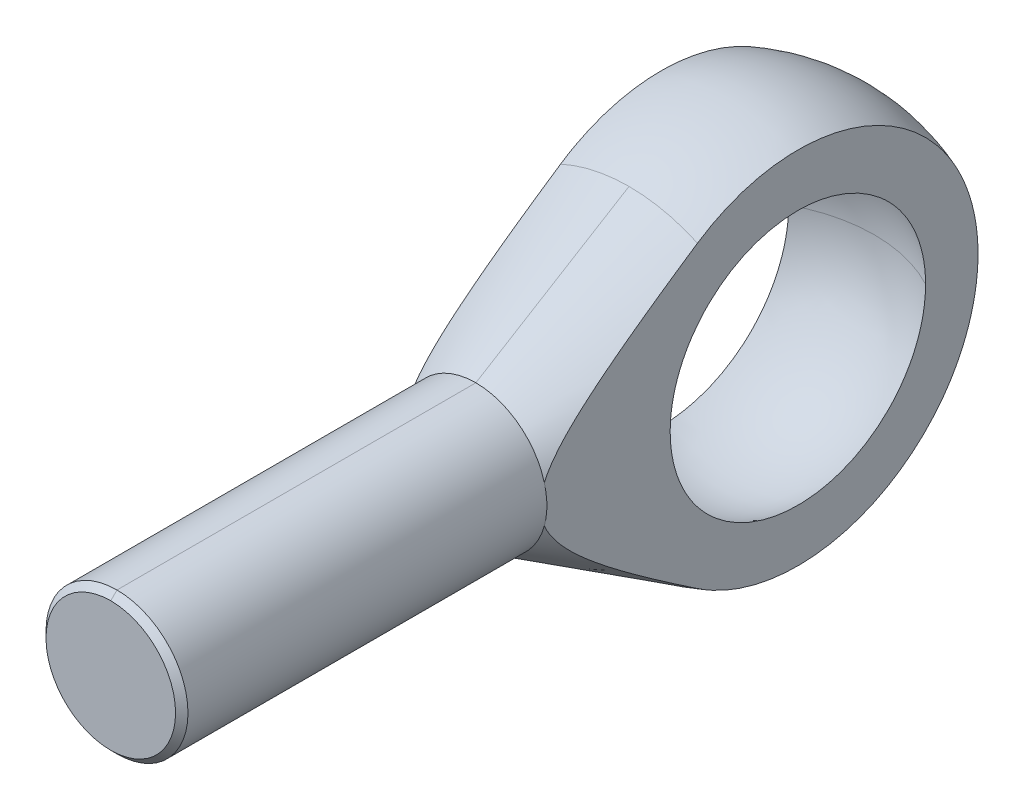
ISO-10303-21;
HEADER;
FILE_DESCRIPTION(('STEP AP214'),'2;1');
FILE_NAME('part.step','',(''),(''),'','','');
FILE_SCHEMA(('AUTOMOTIVE_DESIGN { 1 0 10303 214 1 1 1 1 }'));
ENDSEC;
DATA;
#1=APPLICATION_CONTEXT('core data for automotive mechanical design processes');
#2=APPLICATION_PROTOCOL_DEFINITION('international standard','automotive_design',2000,#1);
#3=PRODUCT_CONTEXT('',#1,'mechanical');
#4=PRODUCT('Part','Part','',(#3));
#5=PRODUCT_RELATED_PRODUCT_CATEGORY('part','',(#4));
#6=PRODUCT_DEFINITION_FORMATION('','',#4);
#7=PRODUCT_DEFINITION_CONTEXT('part definition',#1,'design');
#8=PRODUCT_DEFINITION('design','',#6,#7);
#9=PRODUCT_DEFINITION_SHAPE('','',#8);
#10=(LENGTH_UNIT() NAMED_UNIT(*) SI_UNIT(.MILLI.,.METRE.));
#11=(NAMED_UNIT(*) PLANE_ANGLE_UNIT() SI_UNIT($,.RADIAN.));
#12=(NAMED_UNIT(*) SI_UNIT($,.STERADIAN.) SOLID_ANGLE_UNIT());
#13=UNCERTAINTY_MEASURE_WITH_UNIT(LENGTH_MEASURE(1.E-05),#10,'distance_accuracy_value','');
#14=(GEOMETRIC_REPRESENTATION_CONTEXT(3) GLOBAL_UNCERTAINTY_ASSIGNED_CONTEXT((#13)) GLOBAL_UNIT_ASSIGNED_CONTEXT((#10,
#11,#12)) REPRESENTATION_CONTEXT('',''));
#15=CARTESIAN_POINT('',(0.,0.,0.));
#16=DIRECTION('',(0.,0.,1.));
#17=DIRECTION('',(1.,0.,0.));
#18=AXIS2_PLACEMENT_3D('',#15,#16,#17);
#19=CARTESIAN_POINT('',(0.,0.,0.));
#20=DIRECTION('',(0.,0.,1.));
#21=DIRECTION('',(0.,1.,0.));
#22=AXIS2_PLACEMENT_3D('',#19,#20,#21);
#23=SPHERICAL_SURFACE('',#22,14.285);
#24=CARTESIAN_POINT('',(0.,0.,-14.285));
#25=CARTESIAN_POINT('',(-0.146466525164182,2.73488111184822E-12,-14.2850007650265));
#26=CARTESIAN_POINT('',(-0.292933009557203,5.12764235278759E-12,-14.2827474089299));
#27=CARTESIAN_POINT('',(-0.585727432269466,9.2918009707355E-12,-14.2737379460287));
#28=CARTESIAN_POINT('',(-0.732055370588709,1.10631983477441E-11,-14.266981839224));
#29=CARTESIAN_POINT('',(-1.02443423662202,1.40475051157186E-11,-14.2489723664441));
#30=CARTESIAN_POINT('',(-1.17048516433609,1.52604145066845E-11,-14.2377190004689));
#31=CARTESIAN_POINT('',(-1.46217184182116,1.71919995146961E-11,-14.2107258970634));
#32=CARTESIAN_POINT('',(-1.60780759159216,1.79106751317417E-11,-14.194986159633));
#33=CARTESIAN_POINT('',(-1.89852612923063,1.89186593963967E-11,-14.1590351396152));
#34=CARTESIAN_POINT('',(-2.04360891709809,1.9207968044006E-11,-14.1388238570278));
#35=CARTESIAN_POINT('',(-2.33308427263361,1.94221890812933E-11,-14.0939488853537));
#36=CARTESIAN_POINT('',(-2.47747684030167,1.93471014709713E-11,-14.069285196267));
#37=CARTESIAN_POINT('',(-2.76543514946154,1.88982144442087E-11,-14.015528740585));
#38=CARTESIAN_POINT('',(-2.90900089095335,1.85244150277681E-11,-13.9864359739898));
#39=CARTESIAN_POINT('',(-3.1951697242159,1.75444589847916E-11,-13.9238488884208));
#40=CARTESIAN_POINT('',(-3.33777281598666,1.69383023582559E-11,-13.890354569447));
#41=CARTESIAN_POINT('',(-3.62188143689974,1.55578209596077E-11,-13.8189960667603));
#42=CARTESIAN_POINT('',(-3.76338696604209,1.47834961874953E-11,-13.7811318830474));
#43=CARTESIAN_POINT('',(-4.04516658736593,1.31336555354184E-11,-13.7010694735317));
#44=CARTESIAN_POINT('',(-4.18544067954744,1.2258139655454E-11,-13.6588712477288));
#45=CARTESIAN_POINT('',(-4.46462471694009,1.04681165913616E-11,-13.5701806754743));
#46=CARTESIAN_POINT('',(-4.60353466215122,9.55360940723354E-12,-13.5236883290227));
#47=CARTESIAN_POINT('',(-4.87985898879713,7.75191299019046E-12,-13.4264535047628));
#48=CARTESIAN_POINT('',(-5.01727337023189,6.8647237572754E-12,-13.3757110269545));
#49=CARTESIAN_POINT('',(-5.29047655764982,5.17946914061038E-12,-13.2700239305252));
#50=CARTESIAN_POINT('',(-5.42626536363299,4.38140375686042E-12,-13.2150793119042));
#51=CARTESIAN_POINT('',(-5.69608896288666,2.9368762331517E-12,-13.1010399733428));
#52=CARTESIAN_POINT('',(-5.83012375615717,2.29041409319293E-12,-13.0419452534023));
#53=CARTESIAN_POINT('',(-6.09631241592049,1.20858945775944E-12,-12.9196614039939));
#54=CARTESIAN_POINT('',(-6.22846628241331,7.73226962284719E-13,-12.8564722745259));
#55=CARTESIAN_POINT('',(-6.49076846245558,1.73671413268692E-13,-12.726060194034));
#56=CARTESIAN_POINT('',(-6.62091677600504,0.,-12.6588372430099));
#57=CARTESIAN_POINT('',(-6.75,0.,-12.5896276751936));
#58=B_SPLINE_CURVE_WITH_KNOTS('',3,(#24,#25,#26,#27,#28,#29,#30,#31,#32,#33,#34,#35,#36,#37,#38,
#39,#40,#41,#42,#43,#44,#45,#46,#47,#48,#49,#50,#51,#52,#53,#54,#55,#56,#57),.UNSPECIFIED.,.F.,
.F.,(4,2,2,2,2,2,2,2,2,2,2,2,2,2,2,2,4),(0.,0.439382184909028,0.878764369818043,
1.31814655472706,1.75752873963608,2.19691092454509,2.63629310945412,3.07567529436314,
3.51505747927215,3.95443966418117,4.39382184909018,4.8332040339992,5.27258621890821,
5.71196840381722,6.15135058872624,6.59073277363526,7.03011495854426),.UNSPECIFIED.);
#59=CARTESIAN_POINT('',(0.,0.,-14.285));
#60=VERTEX_POINT('',#59);
#61=CARTESIAN_POINT('',(-6.75,0.,-12.5896276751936));
#62=VERTEX_POINT('',#61);
#63=EDGE_CURVE('E357',#60,#62,#58,.T.);
#64=ORIENTED_EDGE('',*,*,#63,.T.);
#65=CARTESIAN_POINT('',(-6.75,0.,-12.5896276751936));
#66=CARTESIAN_POINT('',(-6.75,-0.354096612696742,-12.5896657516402));
#67=CARTESIAN_POINT('',(-6.75,-0.708187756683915,-12.5746902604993));
#68=CARTESIAN_POINT('',(-6.75,-1.41383660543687,-12.5149871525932));
#69=CARTESIAN_POINT('',(-6.75,-1.76539443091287,-12.4702609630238));
#70=CARTESIAN_POINT('',(-6.75,-2.46322484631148,-12.3513763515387));
#71=CARTESIAN_POINT('',(-6.75,-2.80950122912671,-12.2772401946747));
#72=CARTESIAN_POINT('',(-6.75,-3.49457727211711,-12.1000749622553));
#73=CARTESIAN_POINT('',(-6.75,-3.83337702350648,-11.9970462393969));
#74=CARTESIAN_POINT('',(-6.75,-4.50125999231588,-11.7627670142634));
#75=CARTESIAN_POINT('',(-6.75,-4.83033839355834,-11.6315027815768));
#76=CARTESIAN_POINT('',(-6.75,-5.47626631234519,-11.3417163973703));
#77=CARTESIAN_POINT('',(-6.75,-5.79311582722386,-11.1831942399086));
#78=CARTESIAN_POINT('',(-6.75,-6.41227904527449,-10.8400488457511));
#79=CARTESIAN_POINT('',(-6.75,-6.71459526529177,-10.6554301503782));
#80=CARTESIAN_POINT('',(-6.75,-7.30260029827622,-10.2613843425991));
#81=CARTESIAN_POINT('',(-6.75,-7.58828920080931,-10.0519573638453));
#82=CARTESIAN_POINT('',(-6.75,-8.14100794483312,-9.60978496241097));
#83=CARTESIAN_POINT('',(-6.75,-8.40803796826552,-9.37703976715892));
#84=CARTESIAN_POINT('',(-6.75,-8.9215453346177,-8.88988232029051));
#85=CARTESIAN_POINT('',(-6.75,-9.16802256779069,-8.6354699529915));
#86=CARTESIAN_POINT('',(-6.75,-9.63871815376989,-8.10673430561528));
#87=CARTESIAN_POINT('',(-6.75,-9.86293202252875,-7.83240703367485));
#88=CARTESIAN_POINT('',(-6.75,-10.2874468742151,-7.26584221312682));
#89=CARTESIAN_POINT('',(-6.75,-10.4877482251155,-6.97360494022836));
#90=CARTESIAN_POINT('',(-6.75,-10.8630554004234,-6.3732330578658));
#91=CARTESIAN_POINT('',(-6.75,-11.0380561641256,-6.06509528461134));
#92=CARTESIAN_POINT('',(-6.75,-11.3614705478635,-5.43517006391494));
#93=CARTESIAN_POINT('',(-6.75,-11.5098839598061,-5.11338250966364));
#94=CARTESIAN_POINT('',(-6.75,-11.7790040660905,-4.45858670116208));
#95=CARTESIAN_POINT('',(-6.75,-11.8997237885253,-4.12558380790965));
#96=CARTESIAN_POINT('',(-6.75,-12.1126574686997,-3.45072441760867));
#97=CARTESIAN_POINT('',(-6.75,-12.2048782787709,-3.10887007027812));
#98=CARTESIAN_POINT('',(-6.75,-12.384545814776,-2.31028931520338));
#99=CARTESIAN_POINT('',(-6.75,-12.4614489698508,-1.85112209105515));
#100=CARTESIAN_POINT('',(-6.75,-12.5383435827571,-1.15871700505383));
#101=CARTESIAN_POINT('',(-6.75,-12.5575650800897,-0.927440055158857));
#102=CARTESIAN_POINT('',(-6.75,-12.5832073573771,-0.46412784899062));
#103=CARTESIAN_POINT('',(-6.75,-12.5896253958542,-0.232092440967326));
#104=CARTESIAN_POINT('',(-6.75,-12.5896276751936,0.));
#105=B_SPLINE_CURVE_WITH_KNOTS('',3,(#65,#66,#67,#68,#69,#70,#71,#72,#73,#74,#75,#76,#77,#78,
#79,#80,#81,#82,#83,#84,#85,#86,#87,#88,#89,#90,#91,#92,#93,#94,#95,#96,#97,#98,#99,#100,#101,
#102,#103,#104),.UNSPECIFIED.,.F.,.F.,(4,2,2,2,2,2,2,2,2,2,2,2,2,2,2,2,2,2,2,4),(0.,
1.06196559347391,2.12388024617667,3.18499249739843,4.24609179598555,5.30770825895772,
6.36932495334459,7.43075713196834,8.49218359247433,9.5535997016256,10.615021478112,
11.6766566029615,12.7382753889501,13.8001062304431,14.8619453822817,15.9232839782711,
16.9843671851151,18.3778155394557,19.0737413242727,19.7698161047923),.UNSPECIFIED.);
#106=CARTESIAN_POINT('',(-6.75,-12.5896276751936,0.));
#107=VERTEX_POINT('',#106);
#108=EDGE_CURVE('E327',#62,#107,#105,.T.);
#109=ORIENTED_EDGE('',*,*,#108,.T.);
#110=CARTESIAN_POINT('',(-6.75,-12.5896276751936,0.));
#111=CARTESIAN_POINT('',(-6.75,-12.5896657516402,0.354096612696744));
#112=CARTESIAN_POINT('',(-6.75,-12.5746902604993,0.708187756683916));
#113=CARTESIAN_POINT('',(-6.75,-12.5149871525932,1.41383660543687));
#114=CARTESIAN_POINT('',(-6.75,-12.4702609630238,1.76539443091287));
#115=CARTESIAN_POINT('',(-6.75,-12.3513763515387,2.46322484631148));
#116=CARTESIAN_POINT('',(-6.75,-12.2772401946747,2.80950122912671));
#117=CARTESIAN_POINT('',(-6.75,-12.1000749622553,3.4945772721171));
#118=CARTESIAN_POINT('',(-6.75,-11.9970462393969,3.83337702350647));
#119=CARTESIAN_POINT('',(-6.75,-11.7627670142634,4.50125999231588));
#120=CARTESIAN_POINT('',(-6.75,-11.6315027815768,4.83033839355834));
#121=CARTESIAN_POINT('',(-6.75,-11.3417163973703,5.47626631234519));
#122=CARTESIAN_POINT('',(-6.75,-11.1831942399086,5.79311582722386));
#123=CARTESIAN_POINT('',(-6.75,-10.8400488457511,6.41227904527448));
#124=CARTESIAN_POINT('',(-6.75,-10.6554301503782,6.71459526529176));
#125=CARTESIAN_POINT('',(-6.75,-10.2613843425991,7.30260029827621));
#126=CARTESIAN_POINT('',(-6.75,-10.0519573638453,7.5882892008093));
#127=CARTESIAN_POINT('',(-6.75,-9.60978496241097,8.14100794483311));
#128=CARTESIAN_POINT('',(-6.75,-9.37703976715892,8.40803796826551));
#129=CARTESIAN_POINT('',(-6.75,-8.88988232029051,8.92154533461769));
#130=CARTESIAN_POINT('',(-6.75,-8.63546995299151,9.16802256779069));
#131=CARTESIAN_POINT('',(-6.75,-8.10673430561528,9.63871815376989));
#132=CARTESIAN_POINT('',(-6.75,-7.83240703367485,9.86293202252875));
#133=CARTESIAN_POINT('',(-6.75,-7.26584221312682,10.2874468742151));
#134=CARTESIAN_POINT('',(-6.75,-6.97360494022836,10.4877482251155));
#135=CARTESIAN_POINT('',(-6.75,-6.3732330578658,10.8630554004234));
#136=CARTESIAN_POINT('',(-6.75,-6.06509528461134,11.0380561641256));
#137=CARTESIAN_POINT('',(-6.75,-5.43517006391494,11.3614705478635));
#138=CARTESIAN_POINT('',(-6.75,-5.11338250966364,11.5098839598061));
#139=CARTESIAN_POINT('',(-6.75,-4.45858670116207,11.7790040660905));
#140=CARTESIAN_POINT('',(-6.75,-4.12558380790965,11.8997237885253));
#141=CARTESIAN_POINT('',(-6.75,-3.45072441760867,12.1126574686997));
#142=CARTESIAN_POINT('',(-6.75,-3.10887007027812,12.2048782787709));
#143=CARTESIAN_POINT('',(-6.75,-2.31028931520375,12.3845458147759));
#144=CARTESIAN_POINT('',(-6.75,-1.85112209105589,12.4614489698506));
#145=CARTESIAN_POINT('',(-6.75,-1.15871700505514,12.5383435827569));
#146=CARTESIAN_POINT('',(-6.75,-0.92744005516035,12.5575650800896));
#147=CARTESIAN_POINT('',(-6.75,-0.464127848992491,12.583207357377));
#148=CARTESIAN_POINT('',(-6.75,-0.232092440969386,12.5896253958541));
#149=CARTESIAN_POINT('',(-6.75,-2.24993634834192E-12,12.5896276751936));
#150=B_SPLINE_CURVE_WITH_KNOTS('',3,(#110,#111,#112,#113,#114,#115,#116,#117,#118,#119,#120,
#121,#122,#123,#124,#125,#126,#127,#128,#129,#130,#131,#132,#133,#134,#135,#136,#137,#138,#139,
#140,#141,#142,#143,#144,#145,#146,#147,#148,#149),.UNSPECIFIED.,.F.,.F.,(4,2,2,2,2,2,2,2,2,2,2,
2,2,2,2,2,2,2,2,4),(0.,1.06196559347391,2.12388024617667,3.18499249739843,4.24609179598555,
5.30770825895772,6.36932495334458,7.43075713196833,8.49218359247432,9.5535997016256,
10.615021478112,11.6766566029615,12.7382753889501,13.8001062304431,14.8619453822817,
15.9232839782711,16.9843671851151,18.3778155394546,19.073741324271,19.76981610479),.UNSPECIFIED.);
#151=CARTESIAN_POINT('',(-6.75,-7.86313526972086E-12,12.5896276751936));
#152=VERTEX_POINT('',#151);
#153=EDGE_CURVE('E337',#107,#152,#150,.T.);
#154=ORIENTED_EDGE('',*,*,#153,.T.);
#155=CARTESIAN_POINT('',(0.,0.,0.));
#156=DIRECTION('',(1.99700794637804E-12,-1.,0.));
#157=DIRECTION('',(0.,0.,1.));
#158=AXIS2_PLACEMENT_3D('',#155,#156,#157);
#159=CIRCLE('',#158,14.285);
#160=CARTESIAN_POINT('',(0.,0.,14.285));
#161=VERTEX_POINT('',#160);
#162=EDGE_CURVE('E361',#152,#161,#159,.F.);
#163=ORIENTED_EDGE('',*,*,#162,.T.);
#164=CARTESIAN_POINT('',(0.,0.,14.285));
#165=CARTESIAN_POINT('',(0.146466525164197,-2.73471507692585E-12,14.2850007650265));
#166=CARTESIAN_POINT('',(0.292933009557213,-5.12724475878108E-12,14.2827474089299));
#167=CARTESIAN_POINT('',(0.585727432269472,-9.29094045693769E-12,14.2737379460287));
#168=CARTESIAN_POINT('',(0.732055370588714,-1.10621064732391E-11,14.266981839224));
#169=CARTESIAN_POINT('',(1.02443423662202,-1.40460819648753E-11,14.2489723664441));
#170=CARTESIAN_POINT('',(1.17048516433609,-1.52588914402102E-11,14.2377190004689));
#171=CARTESIAN_POINT('',(1.46217184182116,-1.71897530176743E-11,14.2107258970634));
#172=CARTESIAN_POINT('',(1.60780759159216,-1.79078051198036E-11,14.194986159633));
#173=CARTESIAN_POINT('',(1.89852612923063,-1.89157303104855E-11,14.1590351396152));
#174=CARTESIAN_POINT('',(2.04360891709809,-1.92056033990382E-11,14.1388238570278));
#175=CARTESIAN_POINT('',(2.33308427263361,-1.94192587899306E-11,14.0939488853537));
#176=CARTESIAN_POINT('',(2.47747684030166,-1.93430410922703E-11,14.069285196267));
#177=CARTESIAN_POINT('',(2.76543514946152,-1.8893603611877E-11,14.015528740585));
#178=CARTESIAN_POINT('',(2.90900089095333,-1.85203838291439E-11,13.9864359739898));
#179=CARTESIAN_POINT('',(3.19516972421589,-1.75397499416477E-11,13.9238488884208));
#180=CARTESIAN_POINT('',(3.33777281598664,-1.69323358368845E-11,13.890354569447));
#181=CARTESIAN_POINT('',(3.62188143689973,-1.55522769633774E-11,13.8189960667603));
#182=CARTESIAN_POINT('',(3.76338696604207,-1.47796321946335E-11,13.7811318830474));
#183=CARTESIAN_POINT('',(4.04516658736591,-1.31298065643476E-11,13.7010694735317));
#184=CARTESIAN_POINT('',(4.18544067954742,-1.22526257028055E-11,13.6588712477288));
#185=CARTESIAN_POINT('',(4.46462471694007,-1.04593242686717E-11,13.5701806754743));
#186=CARTESIAN_POINT('',(4.6035346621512,-9.5432036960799E-12,13.5236883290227));
#187=CARTESIAN_POINT('',(4.87985898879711,-7.74242271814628E-12,13.4264535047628));
#188=CARTESIAN_POINT('',(5.01727337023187,-6.85776231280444E-12,13.3757110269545));
#189=CARTESIAN_POINT('',(5.2904765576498,-5.17396023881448E-12,13.2700239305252));
#190=CARTESIAN_POINT('',(5.42626536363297,-4.37481857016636E-12,13.2150793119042));
#191=CARTESIAN_POINT('',(5.69608896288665,-2.92753590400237E-12,13.1010399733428));
#192=CARTESIAN_POINT('',(5.83012375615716,-2.27939490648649E-12,13.0419452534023));
#193=CARTESIAN_POINT('',(6.09631241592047,-1.19723540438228E-12,12.9196614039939));
#194=CARTESIAN_POINT('',(6.22846628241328,-7.63216899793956E-13,12.8564722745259));
#195=CARTESIAN_POINT('',(6.49076846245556,-1.65469470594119E-13,12.726060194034));
#196=CARTESIAN_POINT('',(6.62091677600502,0.,12.6588372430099));
#197=CARTESIAN_POINT('',(6.74999999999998,0.,12.5896276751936));
#198=B_SPLINE_CURVE_WITH_KNOTS('',3,(#164,#165,#166,#167,#168,#169,#170,#171,#172,#173,#174,
#175,#176,#177,#178,#179,#180,#181,#182,#183,#184,#185,#186,#187,#188,#189,#190,#191,#192,#193,
#194,#195,#196,#197),.UNSPECIFIED.,.F.,.F.,(4,2,2,2,2,2,2,2,2,2,2,2,2,2,2,2,4),(0.,
0.439382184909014,0.878764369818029,1.31814655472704,1.75752873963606,2.19691092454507,
2.63629310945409,3.0756752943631,3.51505747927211,3.95443966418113,4.39382184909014,
4.83320403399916,5.27258621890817,5.71196840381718,6.1513505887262,6.59073277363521,
7.03011495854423),.UNSPECIFIED.);
#199=CARTESIAN_POINT('',(6.75,-2.24733426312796E-12,12.5896276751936));
#200=VERTEX_POINT('',#199);
#201=EDGE_CURVE('E91',#161,#200,#198,.T.);
#202=ORIENTED_EDGE('',*,*,#201,.T.);
#203=CARTESIAN_POINT('',(6.75,-2.24993634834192E-12,12.5896276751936));
#204=CARTESIAN_POINT('',(6.75,-0.354087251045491,12.589665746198));
#205=CARTESIAN_POINT('',(6.75,-0.708169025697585,12.5746910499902));
#206=CARTESIAN_POINT('',(6.75,-1.41379936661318,12.5149910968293));
#207=CARTESIAN_POINT('',(6.75,-1.76534805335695,12.4702672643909));
#208=CARTESIAN_POINT('',(6.75,-2.46317900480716,12.3513857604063));
#209=CARTESIAN_POINT('',(6.75,-2.80946479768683,12.2772488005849));
#210=CARTESIAN_POINT('',(6.75,-3.49455934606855,12.1000804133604));
#211=CARTESIAN_POINT('',(6.75,-3.83336819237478,11.9970493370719));
#212=CARTESIAN_POINT('',(6.75,-4.5012634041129,11.7627658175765));
#213=CARTESIAN_POINT('',(6.75,-4.83034511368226,11.6315001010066));
#214=CARTESIAN_POINT('',(6.75,-5.47627934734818,11.3417102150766));
#215=CARTESIAN_POINT('',(6.75,-5.79313186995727,11.183186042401));
#216=CARTESIAN_POINT('',(6.75,-6.41229435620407,10.8400396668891));
#217=CARTESIAN_POINT('',(6.75,-6.7146071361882,10.6554225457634));
#218=CARTESIAN_POINT('',(6.75,-7.30260586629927,10.2613802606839));
#219=CARTESIAN_POINT('',(6.75,-7.58829189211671,10.0519552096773));
#220=CARTESIAN_POINT('',(6.75,-8.14101443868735,9.60977976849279));
#221=CARTESIAN_POINT('',(6.75,-8.40805052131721,9.37702883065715));
#222=CARTESIAN_POINT('',(6.75,-8.92156807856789,8.88985977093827));
#223=CARTESIAN_POINT('',(6.75,-9.16804951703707,8.63544161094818));
#224=CARTESIAN_POINT('',(6.75,-9.63874097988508,8.10670673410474));
#225=CARTESIAN_POINT('',(6.75,-9.86294761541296,7.83238700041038));
#226=CARTESIAN_POINT('',(6.75,-10.287452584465,7.26583381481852));
#227=CARTESIAN_POINT('',(6.75,-10.4877509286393,6.97360037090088));
#228=CARTESIAN_POINT('',(6.75,-10.8630069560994,6.37331079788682));
#229=CARTESIAN_POINT('',(6.75,-11.0379657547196,6.06525536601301));
#230=CARTESIAN_POINT('',(6.75,-11.361309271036,5.43550018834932));
#231=CARTESIAN_POINT('',(6.75,-11.5096939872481,5.11380044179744));
#232=CARTESIAN_POINT('',(6.75,-11.7788256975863,4.45906490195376));
#233=CARTESIAN_POINT('',(6.75,-11.8995744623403,4.12602983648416));
#234=CARTESIAN_POINT('',(6.75,-12.1125880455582,3.45097166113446));
#235=CARTESIAN_POINT('',(6.75,-12.2048528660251,3.10894855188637));
#236=CARTESIAN_POINT('',(6.75,-12.3602442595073,2.41833859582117));
#237=CARTESIAN_POINT('',(6.75,-12.4233702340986,2.06975161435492));
#238=CARTESIAN_POINT('',(6.75,-12.5200323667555,1.36849891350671));
#239=CARTESIAN_POINT('',(6.75,-12.5535685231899,1.0158331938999));
#240=CARTESIAN_POINT('',(6.75,-12.5908130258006,0.308922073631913));
#241=CARTESIAN_POINT('',(6.75,-12.5945206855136,-0.0453233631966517));
#242=CARTESIAN_POINT('',(6.75,-12.5720800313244,-0.752867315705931));
#243=CARTESIAN_POINT('',(6.75,-12.5459317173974,-1.10616583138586));
#244=CARTESIAN_POINT('',(6.75,-12.4639654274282,-1.80930065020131));
#245=CARTESIAN_POINT('',(6.75,-12.4081477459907,-2.15913698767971));
#246=CARTESIAN_POINT('',(6.75,-12.2672397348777,-2.85286387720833));
#247=CARTESIAN_POINT('',(6.75,-12.1821494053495,-3.19675442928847));
#248=CARTESIAN_POINT('',(6.75,-11.9833013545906,-3.87614381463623));
#249=CARTESIAN_POINT('',(6.75,-11.8695437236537,-4.21164267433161));
#250=CARTESIAN_POINT('',(6.75,-11.6141696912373,-4.87186459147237));
#251=CARTESIAN_POINT('',(6.75,-11.4725532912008,-5.19658764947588));
#252=CARTESIAN_POINT('',(6.75,-11.1624644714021,-5.83295771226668));
#253=CARTESIAN_POINT('',(6.75,-10.9939913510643,-6.14460437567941));
#254=CARTESIAN_POINT('',(6.75,-10.6313894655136,-6.75259704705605));
#255=CARTESIAN_POINT('',(6.75,-10.4372606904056,-7.04894304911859));
#256=CARTESIAN_POINT('',(6.75,-10.0247377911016,-7.62421333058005));
#257=CARTESIAN_POINT('',(6.75,-9.80634484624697,-7.90313845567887));
#258=CARTESIAN_POINT('',(6.75,-9.34683892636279,-8.44159927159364));
#259=CARTESIAN_POINT('',(6.75,-9.10572599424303,-8.70113499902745));
#260=CARTESIAN_POINT('',(6.75,-8.60252843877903,-9.19893832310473));
#261=CARTESIAN_POINT('',(6.75,-8.34044670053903,-9.43720883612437));
#262=CARTESIAN_POINT('',(6.75,-7.79714331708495,-9.89083008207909));
#263=CARTESIAN_POINT('',(6.75,-7.51592152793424,-10.1061806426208));
#264=CARTESIAN_POINT('',(6.75,-6.9362428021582,-10.512496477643));
#265=CARTESIAN_POINT('',(6.75,-6.63778020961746,-10.7034536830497));
#266=CARTESIAN_POINT('',(6.75,-6.02583609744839,-11.0595360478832));
#267=CARTESIAN_POINT('',(6.75,-5.71235503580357,-11.2246619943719));
#268=CARTESIAN_POINT('',(6.75,-5.07239483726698,-11.5280097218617));
#269=CARTESIAN_POINT('',(6.75,-4.74590767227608,-11.6662145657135));
#270=CARTESIAN_POINT('',(6.75,-4.08244352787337,-11.9146063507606));
#271=CARTESIAN_POINT('',(6.75,-3.74546661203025,-12.0247934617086));
#272=CARTESIAN_POINT('',(6.75,-3.06387134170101,-12.2162423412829));
#273=CARTESIAN_POINT('',(6.75,-2.71926337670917,-12.2975411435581));
#274=CARTESIAN_POINT('',(6.75,-2.0245624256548,-12.4308032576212));
#275=CARTESIAN_POINT('',(6.75,-1.67447221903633,-12.4827809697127));
#276=CARTESIAN_POINT('',(6.75,-1.10301674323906,-12.5431649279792));
#277=CARTESIAN_POINT('',(6.75,-0.882566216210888,-12.5605995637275));
#278=CARTESIAN_POINT('',(6.75,-0.441418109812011,-12.583822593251));
#279=CARTESIAN_POINT('',(6.75,-0.22072154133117,-12.5896301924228));
#280=CARTESIAN_POINT('',(6.75,0.,-12.5896276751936));
#281=B_SPLINE_CURVE_WITH_KNOTS('',3,(#203,#204,#205,#206,#207,#208,#209,#210,#211,#212,#213,
#214,#215,#216,#217,#218,#219,#220,#221,#222,#223,#224,#225,#226,#227,#228,#229,#230,#231,#232,
#233,#234,#235,#236,#237,#238,#239,#240,#241,#242,#243,#244,#245,#246,#247,#248,#249,#250,#251,
#252,#253,#254,#255,#256,#257,#258,#259,#260,#261,#262,#263,#264,#265,#266,#267,#268,#269,#270,
#271,#272,#273,#274,#275,#276,#277,#278,#279,#280),.UNSPECIFIED.,.F.,.F.,(4,2,2,2,2,2,2,2,2,2,2,
2,2,2,2,2,2,2,2,2,2,2,2,2,2,2,2,2,2,2,2,2,2,2,2,2,2,2,4),(0.,1.06193751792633,2.12382418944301,
3.18496443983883,4.24609179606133,5.30771909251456,6.36934651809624,7.43076747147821,
8.49218359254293,9.5536246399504,10.6150675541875,11.6766717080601,12.7382753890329,
13.7998323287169,14.8613893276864,15.9228782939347,16.9843671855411,18.0458778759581,
19.1073886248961,20.1689238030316,21.2304589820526,22.2919836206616,23.3535082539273,
24.4150295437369,25.4765507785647,26.5380997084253,27.5996490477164,28.661146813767,
29.7226425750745,30.7839925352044,31.8453504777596,32.907058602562,33.9687343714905,
35.0310759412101,36.0934110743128,37.1543793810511,38.214826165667,38.877961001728,
39.5399995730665),.UNSPECIFIED.);
#282=CARTESIAN_POINT('',(6.75,0.,-12.5896276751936));
#283=VERTEX_POINT('',#282);
#284=EDGE_CURVE('E87',#200,#283,#281,.T.);
#285=ORIENTED_EDGE('',*,*,#284,.T.);
#286=CARTESIAN_POINT('',(0.,0.,0.));
#287=DIRECTION('',(0.,1.,0.));
#288=DIRECTION('',(0.,0.,1.));
#289=AXIS2_PLACEMENT_3D('',#286,#287,#288);
#290=CIRCLE('',#289,14.285);
#291=EDGE_CURVE('E358',#283,#60,#290,.T.);
#292=ORIENTED_EDGE('',*,*,#291,.T.);
#293=EDGE_LOOP('',(#64,#109,#154,#163,#202,#285,#292));
#294=FACE_BOUND('',#293,.T.);
#295=ADVANCED_FACE('F14',(#294),#23,.F.);
#296=CARTESIAN_POINT('',(0.,0.,0.));
#297=DIRECTION('',(0.,0.,1.));
#298=DIRECTION('',(0.,1.,0.));
#299=AXIS2_PLACEMENT_3D('',#296,#297,#298);
#300=SPHERICAL_SURFACE('',#299,14.285);
#301=ORIENTED_EDGE('',*,*,#291,.F.);
#302=CARTESIAN_POINT('',(6.75,0.,-12.5896276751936));
#303=CARTESIAN_POINT('',(6.75,0.354096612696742,-12.5896657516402));
#304=CARTESIAN_POINT('',(6.75,0.708187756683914,-12.5746902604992));
#305=CARTESIAN_POINT('',(6.75,1.41383660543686,-12.5149871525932));
#306=CARTESIAN_POINT('',(6.75,1.76539443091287,-12.4702609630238));
#307=CARTESIAN_POINT('',(6.75,2.46322484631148,-12.3513763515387));
#308=CARTESIAN_POINT('',(6.75,2.80950122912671,-12.2772401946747));
#309=CARTESIAN_POINT('',(6.75,3.4945772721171,-12.1000749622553));
#310=CARTESIAN_POINT('',(6.75,3.83337702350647,-11.9970462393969));
#311=CARTESIAN_POINT('',(6.75,4.50125999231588,-11.7627670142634));
#312=CARTESIAN_POINT('',(6.75,4.83033839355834,-11.6315027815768));
#313=CARTESIAN_POINT('',(6.75,5.47626631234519,-11.3417163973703));
#314=CARTESIAN_POINT('',(6.75,5.79311582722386,-11.1831942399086));
#315=CARTESIAN_POINT('',(6.75,6.41227904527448,-10.8400488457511));
#316=CARTESIAN_POINT('',(6.75,6.71459526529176,-10.6554301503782));
#317=CARTESIAN_POINT('',(6.75,7.30260029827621,-10.2613843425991));
#318=CARTESIAN_POINT('',(6.75,7.58828920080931,-10.0519573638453));
#319=CARTESIAN_POINT('',(6.75,8.14100794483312,-9.60978496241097));
#320=CARTESIAN_POINT('',(6.75,8.40803796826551,-9.37703976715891));
#321=CARTESIAN_POINT('',(6.75,8.92154533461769,-8.8898823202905));
#322=CARTESIAN_POINT('',(6.75,9.16802256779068,-8.6354699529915));
#323=CARTESIAN_POINT('',(6.75,9.63871815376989,-8.10673430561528));
#324=CARTESIAN_POINT('',(6.75,9.86293202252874,-7.83240703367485));
#325=CARTESIAN_POINT('',(6.75,10.2874468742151,-7.26584221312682));
#326=CARTESIAN_POINT('',(6.75,10.4877482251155,-6.97360494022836));
#327=CARTESIAN_POINT('',(6.75,10.8630554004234,-6.3732330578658));
#328=CARTESIAN_POINT('',(6.75,11.0380561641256,-6.06509528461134));
#329=CARTESIAN_POINT('',(6.75,11.3614705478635,-5.43517006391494));
#330=CARTESIAN_POINT('',(6.75,11.5098839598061,-5.11338250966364));
#331=CARTESIAN_POINT('',(6.75,11.7790040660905,-4.45858670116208));
#332=CARTESIAN_POINT('',(6.75,11.8997237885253,-4.12558380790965));
#333=CARTESIAN_POINT('',(6.75,12.1126574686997,-3.45072441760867));
#334=CARTESIAN_POINT('',(6.75,12.2048782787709,-3.10887007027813));
#335=CARTESIAN_POINT('',(6.75,12.384545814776,-2.31028931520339));
#336=CARTESIAN_POINT('',(6.75,12.4614489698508,-1.85112209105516));
#337=CARTESIAN_POINT('',(6.75,12.5383435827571,-1.15871700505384));
#338=CARTESIAN_POINT('',(6.75,12.5575650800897,-0.92744005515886));
#339=CARTESIAN_POINT('',(6.75,12.5832073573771,-0.464127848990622));
#340=CARTESIAN_POINT('',(6.75,12.5896253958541,-0.232092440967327));
#341=CARTESIAN_POINT('',(6.75,12.5896276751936,0.));
#342=B_SPLINE_CURVE_WITH_KNOTS('',3,(#302,#303,#304,#305,#306,#307,#308,#309,#310,#311,#312,
#313,#314,#315,#316,#317,#318,#319,#320,#321,#322,#323,#324,#325,#326,#327,#328,#329,#330,#331,
#332,#333,#334,#335,#336,#337,#338,#339,#340,#341),.UNSPECIFIED.,.F.,.F.,(4,2,2,2,2,2,2,2,2,2,2,
2,2,2,2,2,2,2,2,4),(0.,1.06196559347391,2.12388024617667,3.18499249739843,4.24609179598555,
5.30770825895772,6.36932495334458,7.43075713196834,8.49218359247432,9.5535997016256,
10.615021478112,11.6766566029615,12.7382753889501,13.8001062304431,14.8619453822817,
15.923283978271,16.9843671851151,18.3778155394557,19.0737413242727,19.7698161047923),.UNSPECIFIED.);
#343=CARTESIAN_POINT('',(6.75,12.5896276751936,0.));
#344=VERTEX_POINT('',#343);
#345=EDGE_CURVE('E270',#283,#344,#342,.T.);
#346=ORIENTED_EDGE('',*,*,#345,.T.);
#347=CARTESIAN_POINT('',(6.75,12.5896276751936,0.));
#348=CARTESIAN_POINT('',(6.75,12.5896657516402,0.354096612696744));
#349=CARTESIAN_POINT('',(6.75,12.5746902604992,0.708187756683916));
#350=CARTESIAN_POINT('',(6.75,12.5149871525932,1.41383660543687));
#351=CARTESIAN_POINT('',(6.75,12.4702609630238,1.76539443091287));
#352=CARTESIAN_POINT('',(6.75,12.3513763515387,2.46322484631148));
#353=CARTESIAN_POINT('',(6.75,12.2772401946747,2.80950122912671));
#354=CARTESIAN_POINT('',(6.75,12.1000749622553,3.4945772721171));
#355=CARTESIAN_POINT('',(6.75,11.9970462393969,3.83337702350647));
#356=CARTESIAN_POINT('',(6.75,11.7627670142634,4.50125999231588));
#357=CARTESIAN_POINT('',(6.75,11.6315027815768,4.83033839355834));
#358=CARTESIAN_POINT('',(6.75,11.3417163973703,5.47626631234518));
#359=CARTESIAN_POINT('',(6.75,11.1831942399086,5.79311582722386));
#360=CARTESIAN_POINT('',(6.75,10.8400488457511,6.41227904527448));
#361=CARTESIAN_POINT('',(6.75,10.6554301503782,6.71459526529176));
#362=CARTESIAN_POINT('',(6.75,10.2613843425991,7.30260029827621));
#363=CARTESIAN_POINT('',(6.75,10.0519573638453,7.5882892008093));
#364=CARTESIAN_POINT('',(6.75,9.60978496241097,8.14100794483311));
#365=CARTESIAN_POINT('',(6.75,9.37703976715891,8.40803796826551));
#366=CARTESIAN_POINT('',(6.75,8.88988232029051,8.92154533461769));
#367=CARTESIAN_POINT('',(6.75,8.6354699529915,9.16802256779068));
#368=CARTESIAN_POINT('',(6.75,8.10673430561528,9.63871815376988));
#369=CARTESIAN_POINT('',(6.75,7.83240703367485,9.86293202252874));
#370=CARTESIAN_POINT('',(6.75,7.26584221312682,10.2874468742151));
#371=CARTESIAN_POINT('',(6.75,6.97360494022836,10.4877482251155));
#372=CARTESIAN_POINT('',(6.75,6.3732330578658,10.8630554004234));
#373=CARTESIAN_POINT('',(6.75,6.06509528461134,11.0380561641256));
#374=CARTESIAN_POINT('',(6.75,5.43517006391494,11.3614705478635));
#375=CARTESIAN_POINT('',(6.75,5.11338250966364,11.5098839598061));
#376=CARTESIAN_POINT('',(6.75,4.45858670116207,11.7790040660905));
#377=CARTESIAN_POINT('',(6.75,4.12558380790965,11.8997237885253));
#378=CARTESIAN_POINT('',(6.75,3.45072441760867,12.1126574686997));
#379=CARTESIAN_POINT('',(6.75,3.10887007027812,12.2048782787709));
#380=CARTESIAN_POINT('',(6.75,2.31028931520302,12.384545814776));
#381=CARTESIAN_POINT('',(6.75,1.85112209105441,12.4614489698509));
#382=CARTESIAN_POINT('',(6.75,1.15871700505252,12.5383435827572));
#383=CARTESIAN_POINT('',(6.75,0.927440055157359,12.5575650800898));
#384=CARTESIAN_POINT('',(6.75,0.464127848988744,12.5832073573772));
#385=CARTESIAN_POINT('',(6.75,0.232092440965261,12.5896253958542));
#386=CARTESIAN_POINT('',(6.75,-2.24993634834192E-12,12.5896276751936));
#387=B_SPLINE_CURVE_WITH_KNOTS('',3,(#347,#348,#349,#350,#351,#352,#353,#354,#355,#356,#357,
#358,#359,#360,#361,#362,#363,#364,#365,#366,#367,#368,#369,#370,#371,#372,#373,#374,#375,#376,
#377,#378,#379,#380,#381,#382,#383,#384,#385,#386),.UNSPECIFIED.,.F.,.F.,(4,2,2,2,2,2,2,2,2,2,2,
2,2,2,2,2,2,2,2,4),(0.,1.06196559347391,2.12388024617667,3.18499249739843,4.24609179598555,
5.30770825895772,6.36932495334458,7.43075713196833,8.49218359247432,9.55359970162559,
10.615021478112,11.6766566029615,12.7382753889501,13.8001062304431,14.8619453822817,
15.923283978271,16.9843671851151,18.3778155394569,19.0737413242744,19.7698161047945),.UNSPECIFIED.);
#388=EDGE_CURVE('E285',#344,#200,#387,.T.);
#389=ORIENTED_EDGE('',*,*,#388,.T.);
#390=ORIENTED_EDGE('',*,*,#201,.F.);
#391=ORIENTED_EDGE('',*,*,#162,.F.);
#392=CARTESIAN_POINT('',(-6.75,-2.24820162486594E-12,12.5896276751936));
#393=CARTESIAN_POINT('',(-6.75,0.354087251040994,12.5896657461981));
#394=CARTESIAN_POINT('',(-6.75,0.708169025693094,12.5746910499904));
#395=CARTESIAN_POINT('',(-6.75,1.41379936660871,12.5149910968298));
#396=CARTESIAN_POINT('',(-6.75,1.7653480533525,12.4702672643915));
#397=CARTESIAN_POINT('',(-6.75,2.46317900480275,12.3513857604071));
#398=CARTESIAN_POINT('',(-6.75,2.80946479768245,12.2772488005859));
#399=CARTESIAN_POINT('',(-6.75,3.49455934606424,12.1000804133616));
#400=CARTESIAN_POINT('',(-6.75,3.8333681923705,11.9970493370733));
#401=CARTESIAN_POINT('',(-6.75,4.50126340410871,11.7627658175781));
#402=CARTESIAN_POINT('',(-6.75,4.83034511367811,11.6315001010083));
#403=CARTESIAN_POINT('',(-6.75,5.47627934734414,11.3417102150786));
#404=CARTESIAN_POINT('',(-6.75,5.79313186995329,11.1831860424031));
#405=CARTESIAN_POINT('',(-6.75,6.41229435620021,10.8400396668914));
#406=CARTESIAN_POINT('',(-6.75,6.71460713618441,10.6554225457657));
#407=CARTESIAN_POINT('',(-6.75,7.30260586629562,10.2613802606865));
#408=CARTESIAN_POINT('',(-6.75,7.58829189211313,10.05195520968));
#409=CARTESIAN_POINT('',(-6.75,8.14101443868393,9.6097797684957));
#410=CARTESIAN_POINT('',(-6.75,8.40805052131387,9.37702883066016));
#411=CARTESIAN_POINT('',(-6.75,8.92156807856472,8.88985977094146));
#412=CARTESIAN_POINT('',(-6.75,9.16804951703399,8.63544161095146));
#413=CARTESIAN_POINT('',(-6.75,9.63874097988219,8.10670673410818));
#414=CARTESIAN_POINT('',(-6.75,9.86294761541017,7.8323870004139));
#415=CARTESIAN_POINT('',(-6.75,10.2874525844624,7.26583381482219));
#416=CARTESIAN_POINT('',(-6.75,10.4877509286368,6.97360037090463));
#417=CARTESIAN_POINT('',(-6.75,10.8630069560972,6.37331079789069));
#418=CARTESIAN_POINT('',(-6.75,11.0379657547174,6.06525536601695));
#419=CARTESIAN_POINT('',(-6.75,11.3613092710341,5.43550018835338));
#420=CARTESIAN_POINT('',(-6.75,11.5096939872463,5.11380044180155));
#421=CARTESIAN_POINT('',(-6.75,11.7788256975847,4.45906490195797));
#422=CARTESIAN_POINT('',(-6.75,11.8995744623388,4.12602983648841));
#423=CARTESIAN_POINT('',(-6.75,12.112588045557,3.45097166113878));
#424=CARTESIAN_POINT('',(-6.75,12.204852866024,3.10894855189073));
#425=CARTESIAN_POINT('',(-6.75,12.3602442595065,2.41833859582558));
#426=CARTESIAN_POINT('',(-6.75,12.4233702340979,2.06975161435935));
#427=CARTESIAN_POINT('',(-6.75,12.520032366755,1.36849891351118));
#428=CARTESIAN_POINT('',(-6.75,12.5535685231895,1.01583319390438));
#429=CARTESIAN_POINT('',(-6.75,12.5908130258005,0.308922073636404));
#430=CARTESIAN_POINT('',(-6.75,12.5945206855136,-0.0453233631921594));
#431=CARTESIAN_POINT('',(-6.75,12.5720800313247,-0.752867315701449));
#432=CARTESIAN_POINT('',(-6.75,12.5459317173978,-1.10616583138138));
#433=CARTESIAN_POINT('',(-6.75,12.4639654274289,-1.80930065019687));
#434=CARTESIAN_POINT('',(-6.75,12.4081477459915,-2.15913698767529));
#435=CARTESIAN_POINT('',(-6.75,12.2672397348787,-2.85286387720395));
#436=CARTESIAN_POINT('',(-6.75,12.1821494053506,-3.19675442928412));
#437=CARTESIAN_POINT('',(-6.75,11.983301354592,-3.87614381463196));
#438=CARTESIAN_POINT('',(-6.75,11.8695437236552,-4.21164267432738));
#439=CARTESIAN_POINT('',(-6.75,11.614169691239,-4.87186459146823));
#440=CARTESIAN_POINT('',(-6.75,11.4725532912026,-5.19658764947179));
#441=CARTESIAN_POINT('',(-6.75,11.1624644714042,-5.83295771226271));
#442=CARTESIAN_POINT('',(-6.75,10.9939913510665,-6.14460437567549));
#443=CARTESIAN_POINT('',(-6.75,10.631389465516,-6.75259704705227));
#444=CARTESIAN_POINT('',(-6.75,10.4372606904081,-7.04894304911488));
#445=CARTESIAN_POINT('',(-6.75,10.0247377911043,-7.62421333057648));
#446=CARTESIAN_POINT('',(-6.75,9.80634484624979,-7.90313845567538));
#447=CARTESIAN_POINT('',(-6.75,9.34683892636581,-8.44159927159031));
#448=CARTESIAN_POINT('',(-6.75,9.10572599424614,-8.70113499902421));
#449=CARTESIAN_POINT('',(-6.75,8.60252843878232,-9.19893832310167));
#450=CARTESIAN_POINT('',(-6.75,8.3404467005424,-9.4372088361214));
#451=CARTESIAN_POINT('',(-6.75,7.79714331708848,-9.89083008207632));
#452=CARTESIAN_POINT('',(-6.75,7.51592152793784,-10.1061806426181));
#453=CARTESIAN_POINT('',(-6.75,6.93624280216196,-10.5124964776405));
#454=CARTESIAN_POINT('',(-6.75,6.63778020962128,-10.7034536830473));
#455=CARTESIAN_POINT('',(-6.75,6.02583609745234,-11.059536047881));
#456=CARTESIAN_POINT('',(-6.75,5.71235503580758,-11.2246619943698));
#457=CARTESIAN_POINT('',(-6.75,5.07239483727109,-11.5280097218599));
#458=CARTESIAN_POINT('',(-6.75,4.74590767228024,-11.6662145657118));
#459=CARTESIAN_POINT('',(-6.75,4.08244352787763,-11.9146063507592));
#460=CARTESIAN_POINT('',(-6.75,3.74546661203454,-12.0247934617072));
#461=CARTESIAN_POINT('',(-6.75,3.06387134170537,-12.2162423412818));
#462=CARTESIAN_POINT('',(-6.75,2.71926337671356,-12.2975411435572));
#463=CARTESIAN_POINT('',(-6.75,2.02456242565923,-12.4308032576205));
#464=CARTESIAN_POINT('',(-6.75,1.67447221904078,-12.4827809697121));
#465=CARTESIAN_POINT('',(-6.75,1.10301674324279,-12.5431649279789));
#466=CARTESIAN_POINT('',(-6.75,0.882566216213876,-12.5605995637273));
#467=CARTESIAN_POINT('',(-6.75,0.441418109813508,-12.583822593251));
#468=CARTESIAN_POINT('',(-6.75,0.220721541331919,-12.5896301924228));
#469=CARTESIAN_POINT('',(-6.75,0.,-12.5896276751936));
#470=B_SPLINE_CURVE_WITH_KNOTS('',3,(#392,#393,#394,#395,#396,#397,#398,#399,#400,#401,#402,
#403,#404,#405,#406,#407,#408,#409,#410,#411,#412,#413,#414,#415,#416,#417,#418,#419,#420,#421,
#422,#423,#424,#425,#426,#427,#428,#429,#430,#431,#432,#433,#434,#435,#436,#437,#438,#439,#440,
#441,#442,#443,#444,#445,#446,#447,#448,#449,#450,#451,#452,#453,#454,#455,#456,#457,#458,#459,
#460,#461,#462,#463,#464,#465,#466,#467,#468,#469),.UNSPECIFIED.,.F.,.F.,(4,2,2,2,2,2,2,2,2,2,2,
2,2,2,2,2,2,2,2,2,2,2,2,2,2,2,2,2,2,2,2,2,2,2,2,2,2,2,4),(0.,1.06193751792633,2.12382418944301,
3.18496443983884,4.24609179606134,5.30771909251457,6.36934651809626,7.43076747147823,
8.49218359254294,9.55362463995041,10.6150675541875,11.6766717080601,12.7382753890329,
13.7998323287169,14.8613893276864,15.9228782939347,16.9843671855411,18.0458778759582,
19.1073886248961,20.1689238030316,21.2304589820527,22.2919836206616,23.3535082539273,
24.4150295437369,25.4765507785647,26.5380997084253,27.5996490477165,28.661146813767,
29.7226425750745,30.7839925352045,31.8453504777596,32.907058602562,33.9687343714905,
35.0310759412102,36.0934110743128,37.1543793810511,38.214826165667,38.8779610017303,
39.539999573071),.UNSPECIFIED.);
#471=EDGE_CURVE('E331',#152,#62,#470,.T.);
#472=ORIENTED_EDGE('',*,*,#471,.T.);
#473=ORIENTED_EDGE('',*,*,#63,.F.);
#474=EDGE_LOOP('',(#301,#346,#389,#390,#391,#472,#473));
#475=FACE_BOUND('',#474,.T.);
#476=ADVANCED_FACE('F240',(#475),#300,.F.);
#477=CARTESIAN_POINT('',(-6.75,38.,25.));
#478=DIRECTION('',(1.,0.,0.));
#479=DIRECTION('',(0.,0.,-1.));
#480=AXIS2_PLACEMENT_3D('',#477,#478,#479);
#481=PLANE('',#480);
#482=DIRECTION('',(0.,1.,0.));
#483=VECTOR('',#482,1.);
#484=CARTESIAN_POINT('',(-6.75,38.,25.));
#485=LINE('',#484,#483);
#486=CARTESIAN_POINT('',(-6.75,-1.85404962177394,25.));
#487=VERTEX_POINT('',#486);
#488=CARTESIAN_POINT('',(-6.75,1.85404962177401,25.));
#489=VERTEX_POINT('',#488);
#490=EDGE_CURVE('E325',#487,#489,#485,.T.);
#491=ORIENTED_EDGE('',*,*,#490,.T.);
#492=CARTESIAN_POINT('',(-6.75,14.7460308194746,9.89909465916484));
#493=CARTESIAN_POINT('',(-6.75,14.4716553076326,10.3077821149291));
#494=CARTESIAN_POINT('',(-6.75,14.1963921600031,10.7158767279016));
#495=CARTESIAN_POINT('',(-6.75,13.6437058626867,11.5306165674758));
#496=CARTESIAN_POINT('',(-6.75,13.3662826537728,11.9372617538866));
#497=CARTESIAN_POINT('',(-6.75,12.8086035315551,12.749257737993));
#498=CARTESIAN_POINT('',(-6.75,12.528344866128,13.1546066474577));
#499=CARTESIAN_POINT('',(-6.75,11.9647907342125,13.9631833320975));
#500=CARTESIAN_POINT('',(-6.75,11.6814953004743,14.3664111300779));
#501=CARTESIAN_POINT('',(-6.75,11.0975915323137,15.1894760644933));
#502=CARTESIAN_POINT('',(-6.75,10.7968030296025,15.6091855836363));
#503=CARTESIAN_POINT('',(-6.75,10.1902167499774,16.4449671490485));
#504=CARTESIAN_POINT('',(-6.75,9.88441904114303,16.8610392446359));
#505=CARTESIAN_POINT('',(-6.75,9.26664209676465,17.6882649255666));
#506=CARTESIAN_POINT('',(-6.75,8.95466596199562,18.0994208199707));
#507=CARTESIAN_POINT('',(-6.75,8.32257968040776,18.9154078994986));
#508=CARTESIAN_POINT('',(-6.75,8.00247009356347,19.3202395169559));
#509=CARTESIAN_POINT('',(-6.75,7.38003628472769,20.0860614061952));
#510=CARTESIAN_POINT('',(-6.75,7.07861631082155,20.4477814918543));
#511=CARTESIAN_POINT('',(-6.75,6.6175010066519,20.9827719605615));
#512=CARTESIAN_POINT('',(-6.75,6.4622585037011,21.1598804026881));
#513=CARTESIAN_POINT('',(-6.75,6.14830030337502,21.5109946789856));
#514=CARTESIAN_POINT('',(-6.75,5.98958466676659,21.6850005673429));
#515=CARTESIAN_POINT('',(-6.75,5.67048288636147,22.0266753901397));
#516=CARTESIAN_POINT('',(-6.75,5.51015657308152,22.1944000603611));
#517=CARTESIAN_POINT('',(-6.75,5.18488742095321,22.5253072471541));
#518=CARTESIAN_POINT('',(-6.75,5.01994488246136,22.6884900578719));
#519=CARTESIAN_POINT('',(-6.75,4.68468736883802,23.0090824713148));
#520=CARTESIAN_POINT('',(-6.75,4.51437530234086,23.1664951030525));
#521=CARTESIAN_POINT('',(-6.75,4.16732395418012,23.4740344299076));
#522=CARTESIAN_POINT('',(-6.75,3.99058625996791,23.624162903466));
#523=CARTESIAN_POINT('',(-6.75,3.66036247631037,23.89008681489));
#524=CARTESIAN_POINT('',(-6.75,3.50807289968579,24.007361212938));
#525=CARTESIAN_POINT('',(-6.75,3.19759865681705,24.2336360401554));
#526=CARTESIAN_POINT('',(-6.75,3.03941831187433,24.3426423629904));
#527=CARTESIAN_POINT('',(-6.75,2.71468158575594,24.5512911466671));
#528=CARTESIAN_POINT('',(-6.75,2.54805776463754,24.6508301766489));
#529=CARTESIAN_POINT('',(-6.75,2.29235684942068,24.7900075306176));
#530=CARTESIAN_POINT('',(-6.75,2.20605423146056,24.8347595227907));
#531=CARTESIAN_POINT('',(-6.75,2.0315088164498,24.9203987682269));
#532=CARTESIAN_POINT('',(-6.75,1.94326518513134,24.9612843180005));
#533=CARTESIAN_POINT('',(-6.75,1.85404962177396,25.));
#534=B_SPLINE_CURVE_WITH_KNOTS('',3,(#492,#493,#494,#495,#496,#497,#498,#499,#500,#501,#502,
#503,#504,#505,#506,#507,#508,#509,#510,#511,#512,#513,#514,#515,#516,#517,#518,#519,#520,#521,
#522,#523,#524,#525,#526,#527,#528,#529,#530,#531,#532,#533),.UNSPECIFIED.,.F.,.F.,(4,2,2,2,2,2,
2,2,2,2,2,2,2,2,2,2,2,2,2,2,4),(0.,1.47674440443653,2.9535294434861,4.43192025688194,
5.91029514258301,7.45935202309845,9.00838786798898,10.556665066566,12.1048359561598,
13.5171528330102,14.223663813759,14.9301624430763,15.6261670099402,16.3221263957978,
17.0177150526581,17.7131330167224,18.2895494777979,18.865551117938,19.4472574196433,
19.7388182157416,20.0305068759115),.UNSPECIFIED.);
#535=CARTESIAN_POINT('',(-6.75,14.7460308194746,9.89909465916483));
#536=VERTEX_POINT('',#535);
#537=EDGE_CURVE('E291',#536,#489,#534,.T.);
#538=ORIENTED_EDGE('',*,*,#537,.F.);
#539=CARTESIAN_POINT('',(-6.75,0.,-17.7605602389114));
#540=CARTESIAN_POINT('',(-6.75,0.333017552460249,-17.7605708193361));
#541=CARTESIAN_POINT('',(-6.75,0.666033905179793,-17.7511943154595));
#542=CARTESIAN_POINT('',(-6.75,1.33099794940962,-17.7137441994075));
#543=CARTESIAN_POINT('',(-6.75,1.66294569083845,-17.6856714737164));
#544=CARTESIAN_POINT('',(-6.75,2.32473257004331,-17.6109065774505));
#545=CARTESIAN_POINT('',(-6.75,2.65457174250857,-17.5642147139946));
#546=CARTESIAN_POINT('',(-6.75,3.31087120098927,-17.4524026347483));
#547=CARTESIAN_POINT('',(-6.75,3.63733370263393,-17.3872954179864));
#548=CARTESIAN_POINT('',(-6.75,4.28608648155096,-17.2388422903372));
#549=CARTESIAN_POINT('',(-6.75,4.60837680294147,-17.1554965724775));
#550=CARTESIAN_POINT('',(-6.75,5.24774817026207,-16.9708393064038));
#551=CARTESIAN_POINT('',(-6.75,5.56482924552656,-16.8695278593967));
#552=CARTESIAN_POINT('',(-6.75,6.34998257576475,-16.5941080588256));
#553=CARTESIAN_POINT('',(-6.75,6.81421949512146,-16.4089395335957));
#554=CARTESIAN_POINT('',(-6.75,7.7255152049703,-16.0001041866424));
#555=CARTESIAN_POINT('',(-6.75,8.17257172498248,-15.7764322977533));
#556=CARTESIAN_POINT('',(-6.75,8.82771036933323,-15.4133519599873));
#557=CARTESIAN_POINT('',(-6.75,9.04352666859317,-15.2877223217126));
#558=CARTESIAN_POINT('',(-6.75,9.46961201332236,-15.0275163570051));
#559=CARTESIAN_POINT('',(-6.75,9.67988260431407,-14.8929425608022));
#560=CARTESIAN_POINT('',(-6.75,10.3019402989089,-14.4760706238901));
#561=CARTESIAN_POINT('',(-6.75,10.7050109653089,-14.1806010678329));
#562=CARTESIAN_POINT('',(-6.75,11.4847864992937,-13.5567904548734));
#563=CARTESIAN_POINT('',(-6.75,11.8614907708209,-13.2284486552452));
#564=CARTESIAN_POINT('',(-6.75,12.5859172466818,-12.5411893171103));
#565=CARTESIAN_POINT('',(-6.75,12.9336393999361,-12.1822717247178));
#566=CARTESIAN_POINT('',(-6.75,13.597659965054,-11.4363682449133));
#567=CARTESIAN_POINT('',(-6.75,13.9139536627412,-11.0493781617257));
#568=CARTESIAN_POINT('',(-6.75,14.5128140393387,-10.2501260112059));
#569=CARTESIAN_POINT('',(-6.75,14.7953807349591,-9.83786395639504));
#570=CARTESIAN_POINT('',(-6.75,15.3247690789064,-8.99101214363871));
#571=CARTESIAN_POINT('',(-6.75,15.5715917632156,-8.55642303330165));
#572=CARTESIAN_POINT('',(-6.75,16.0277473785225,-7.66799577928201));
#573=CARTESIAN_POINT('',(-6.75,16.2370802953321,-7.2141576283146));
#574=CARTESIAN_POINT('',(-6.75,16.6167503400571,-6.29050129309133));
#575=CARTESIAN_POINT('',(-6.75,16.7870910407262,-5.82068457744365));
#576=CARTESIAN_POINT('',(-6.75,17.0875902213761,-4.86837381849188));
#577=CARTESIAN_POINT('',(-6.75,17.2177487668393,-4.38587979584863));
#578=CARTESIAN_POINT('',(-6.75,17.4369493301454,-3.41167750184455));
#579=CARTESIAN_POINT('',(-6.75,17.5259947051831,-2.91996998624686));
#580=CARTESIAN_POINT('',(-6.75,17.6623538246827,-1.93081631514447));
#581=CARTESIAN_POINT('',(-6.75,17.7096673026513,-1.43337012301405));
#582=CARTESIAN_POINT('',(-6.75,17.7622259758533,-0.436064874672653));
#583=CARTESIAN_POINT('',(-6.75,17.76746020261,0.0637947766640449));
#584=CARTESIAN_POINT('',(-6.75,17.7437277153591,0.812416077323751));
#585=CARTESIAN_POINT('',(-6.75,17.7305519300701,1.06177027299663));
#586=CARTESIAN_POINT('',(-6.75,17.6936988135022,1.55976730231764));
#587=CARTESIAN_POINT('',(-6.75,17.6700187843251,1.80840993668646));
#588=CARTESIAN_POINT('',(-6.75,17.5832559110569,2.55266205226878));
#589=CARTESIAN_POINT('',(-6.75,17.5044526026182,3.04652276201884));
#590=CARTESIAN_POINT('',(-6.75,17.3054842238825,4.02583880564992));
#591=CARTESIAN_POINT('',(-6.75,17.1853192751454,4.51129416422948));
#592=CARTESIAN_POINT('',(-6.75,16.9748077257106,5.23027220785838));
#593=CARTESIAN_POINT('',(-6.75,16.8996229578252,5.46832042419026));
#594=CARTESIAN_POINT('',(-6.75,16.7393120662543,5.94097624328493));
#595=CARTESIAN_POINT('',(-6.75,16.6541884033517,6.17558468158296));
#596=CARTESIAN_POINT('',(-6.75,16.3841473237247,6.87356849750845));
#597=CARTESIAN_POINT('',(-6.75,16.1844870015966,7.33135094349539));
#598=CARTESIAN_POINT('',(-6.75,15.7871085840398,8.14686795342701));
#599=CARTESIAN_POINT('',(-6.75,15.595626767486,8.50767000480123));
#600=CARTESIAN_POINT('',(-6.75,15.1886449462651,9.2145932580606));
#601=CARTESIAN_POINT('',(-6.75,14.973189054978,9.56073985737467));
#602=CARTESIAN_POINT('',(-6.75,14.7460308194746,9.89909465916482));
#603=B_SPLINE_CURVE_WITH_KNOTS('',3,(#539,#540,#541,#542,#543,#544,#545,#546,#547,#548,#549,
#550,#551,#552,#553,#554,#555,#556,#557,#558,#559,#560,#561,#562,#563,#564,#565,#566,#567,#568,
#569,#570,#571,#572,#573,#574,#575,#576,#577,#578,#579,#580,#581,#582,#583,#584,#585,#586,#587,
#588,#589,#590,#591,#592,#593,#594,#595,#596,#597,#598,#599,#600,#601,#602),.UNSPECIFIED.,.F.,
.F.,(4,2,2,2,2,2,2,2,2,2,2,2,2,2,2,2,2,2,2,2,2,2,2,2,2,2,2,2,2,2,2,4),(0.,0.998918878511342,
1.99779039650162,2.99664543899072,3.99479716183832,4.99293832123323,5.99107385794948,
7.48864143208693,8.98640624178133,9.73536860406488,10.4841199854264,11.9814940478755,
13.4789019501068,14.9763124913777,16.4739473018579,17.971581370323,19.4691720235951,
20.9667632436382,22.4642171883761,23.9616686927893,25.458997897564,26.9563366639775,
28.4540657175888,29.2029811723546,29.952089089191,31.4505232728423,32.9489530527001,
33.6976744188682,34.4462107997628,35.942508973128,37.1669844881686,38.389243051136),.UNSPECIFIED.);
#604=CARTESIAN_POINT('',(-6.75,0.,-17.7605602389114));
#605=VERTEX_POINT('',#604);
#606=EDGE_CURVE('E438',#605,#536,#603,.T.);
#607=ORIENTED_EDGE('',*,*,#606,.F.);
#608=CARTESIAN_POINT('',(-6.75,-14.7460308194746,9.89909465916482));
#609=CARTESIAN_POINT('',(-6.75,-14.9316515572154,9.62260662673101));
#610=CARTESIAN_POINT('',(-6.75,-15.1094778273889,9.34088756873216));
#611=CARTESIAN_POINT('',(-6.75,-15.4490111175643,8.76791563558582));
#612=CARTESIAN_POINT('',(-6.75,-15.6107189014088,8.47666321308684));
#613=CARTESIAN_POINT('',(-6.75,-15.9175000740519,7.88553126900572));
#614=CARTESIAN_POINT('',(-6.75,-16.062573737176,7.58565188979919));
#615=CARTESIAN_POINT('',(-6.75,-16.3355373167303,6.9784272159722));
#616=CARTESIAN_POINT('',(-6.75,-16.4634392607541,6.67108732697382));
#617=CARTESIAN_POINT('',(-6.75,-16.7017746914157,6.04970602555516));
#618=CARTESIAN_POINT('',(-6.75,-16.8122083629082,5.73566468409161));
#619=CARTESIAN_POINT('',(-6.75,-17.015255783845,5.10189359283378));
#620=CARTESIAN_POINT('',(-6.75,-17.1078696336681,4.78216387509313));
#621=CARTESIAN_POINT('',(-6.75,-17.3168133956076,3.97676687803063));
#622=CARTESIAN_POINT('',(-6.75,-17.4218227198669,3.48811941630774));
#623=CARTESIAN_POINT('',(-6.75,-17.590302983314,2.50362938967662));
#624=CARTESIAN_POINT('',(-6.75,-17.6537684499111,2.00778588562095));
#625=CARTESIAN_POINT('',(-6.75,-17.7174649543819,1.26147714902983));
#626=CARTESIAN_POINT('',(-6.75,-17.733446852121,1.01227028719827));
#627=CARTESIAN_POINT('',(-6.75,-17.7548906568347,0.513475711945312));
#628=CARTESIAN_POINT('',(-6.75,-17.7603555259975,0.263888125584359));
#629=CARTESIAN_POINT('',(-6.75,-17.7609524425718,-0.484936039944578));
#630=CARTESIAN_POINT('',(-6.75,-17.7402904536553,-0.984276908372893));
#631=CARTESIAN_POINT('',(-6.75,-17.6569789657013,-1.97938934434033));
#632=CARTESIAN_POINT('',(-6.75,-17.5943285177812,-2.4751608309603));
#633=CARTESIAN_POINT('',(-6.75,-17.4274879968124,-3.45968272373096));
#634=CARTESIAN_POINT('',(-6.75,-17.3232978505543,-3.94843311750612));
#635=CARTESIAN_POINT('',(-6.75,-17.0740988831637,-4.9154880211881));
#636=CARTESIAN_POINT('',(-6.75,-16.9290839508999,-5.39379095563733));
#637=CARTESIAN_POINT('',(-6.75,-16.5992733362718,-6.33648003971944));
#638=CARTESIAN_POINT('',(-6.75,-16.4144776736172,-6.80086619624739));
#639=CARTESIAN_POINT('',(-6.75,-16.0064253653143,-7.71240518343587));
#640=CARTESIAN_POINT('',(-6.75,-15.7831698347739,-8.15955851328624));
#641=CARTESIAN_POINT('',(-6.75,-15.2997814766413,-9.03346733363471));
#642=CARTESIAN_POINT('',(-6.75,-15.0396486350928,-9.4602228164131));
#643=CARTESIAN_POINT('',(-6.75,-14.4843803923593,-10.2902635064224));
#644=CARTESIAN_POINT('',(-6.75,-14.189248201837,-10.6935508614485));
#645=CARTESIAN_POINT('',(-6.75,-13.5660621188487,-11.4738294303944));
#646=CARTESIAN_POINT('',(-6.75,-13.2380082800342,-11.8508206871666));
#647=CARTESIAN_POINT('',(-6.75,-12.551333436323,-12.5758011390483));
#648=CARTESIAN_POINT('',(-6.75,-12.1927149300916,-12.9237927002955));
#649=CARTESIAN_POINT('',(-6.75,-11.4474536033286,-13.5883258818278));
#650=CARTESIAN_POINT('',(-6.75,-11.0608106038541,-13.9048673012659));
#651=CARTESIAN_POINT('',(-6.75,-10.262073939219,-14.504367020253));
#652=CARTESIAN_POINT('',(-6.75,-9.84997366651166,-14.7873165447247));
#653=CARTESIAN_POINT('',(-6.75,-9.21518947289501,-15.1848666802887));
#654=CARTESIAN_POINT('',(-6.75,-9.00081487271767,-15.3129082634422));
#655=CARTESIAN_POINT('',(-6.75,-8.56680311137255,-15.5598758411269));
#656=CARTESIAN_POINT('',(-6.75,-8.34716461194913,-15.6787994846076));
#657=CARTESIAN_POINT('',(-6.75,-7.68087715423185,-16.0215822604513));
#658=CARTESIAN_POINT('',(-6.75,-7.22691812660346,-16.231414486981));
#659=CARTESIAN_POINT('',(-6.75,-6.30292523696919,-16.6120527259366));
#660=CARTESIAN_POINT('',(-6.75,-5.83289142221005,-16.7828588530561));
#661=CARTESIAN_POINT('',(-6.75,-5.11861518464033,-17.0088101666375));
#662=CARTESIAN_POINT('',(-6.75,-4.87906601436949,-17.0790661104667));
#663=CARTESIAN_POINT('',(-6.75,-4.39728335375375,-17.2094063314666));
#664=CARTESIAN_POINT('',(-6.75,-4.15505054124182,-17.2694931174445));
#665=CARTESIAN_POINT('',(-6.75,-3.42502553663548,-17.4343175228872));
#666=CARTESIAN_POINT('',(-6.75,-2.93365981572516,-17.5236972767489));
#667=CARTESIAN_POINT('',(-6.75,-2.03507748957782,-17.6483062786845));
#668=CARTESIAN_POINT('',(-6.75,-1.62878992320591,-17.6904230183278));
#669=CARTESIAN_POINT('',(-6.75,-0.815016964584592,-17.7465323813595));
#670=CARTESIAN_POINT('',(-6.75,-0.407535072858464,-17.7605757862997));
#671=CARTESIAN_POINT('',(-6.75,0.,-17.7605602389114));
#672=B_SPLINE_CURVE_WITH_KNOTS('',3,(#608,#609,#610,#611,#612,#613,#614,#615,#616,#617,#618,
#619,#620,#621,#622,#623,#624,#625,#626,#627,#628,#629,#630,#631,#632,#633,#634,#635,#636,#637,
#638,#639,#640,#641,#642,#643,#644,#645,#646,#647,#648,#649,#650,#651,#652,#653,#654,#655,#656,
#657,#658,#659,#660,#661,#662,#663,#664,#665,#666,#667,#668,#669,#670,#671),.UNSPECIFIED.,.F.,
.F.,(4,2,2,2,2,2,2,2,2,2,2,2,2,2,2,2,2,2,2,2,2,2,2,2,2,2,2,2,2,2,2,4),(0.,0.998918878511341,
1.99779039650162,2.99664543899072,3.99479716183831,4.99293832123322,5.99107385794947,
7.48864143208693,8.98640624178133,9.73536860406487,10.4841199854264,11.9814940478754,
13.4789019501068,14.9763124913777,16.4739473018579,17.971581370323,19.4691720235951,
20.9667632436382,22.4642171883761,23.9616686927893,25.458997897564,26.9563366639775,
28.4540657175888,29.2029811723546,29.952089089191,31.4505232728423,32.9489530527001,
33.6976744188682,34.4462107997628,35.942508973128,37.1669844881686,38.389243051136),.UNSPECIFIED.);
#673=CARTESIAN_POINT('',(-6.75,-14.7460308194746,9.89909465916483));
#674=VERTEX_POINT('',#673);
#675=EDGE_CURVE('E294',#674,#605,#672,.T.);
#676=ORIENTED_EDGE('',*,*,#675,.F.);
#677=CARTESIAN_POINT('',(-6.75,-1.85404962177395,25.));
#678=CARTESIAN_POINT('',(-6.75,-1.96648109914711,24.9512048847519));
#679=CARTESIAN_POINT('',(-6.75,-2.07735619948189,24.8989773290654));
#680=CARTESIAN_POINT('',(-6.75,-2.29600801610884,24.7885819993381));
#681=CARTESIAN_POINT('',(-6.75,-2.40378709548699,24.7304189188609));
#682=CARTESIAN_POINT('',(-6.75,-2.72194054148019,24.5487566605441));
#683=CARTESIAN_POINT('',(-6.75,-2.92799796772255,24.4176937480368));
#684=CARTESIAN_POINT('',(-6.75,-3.32762267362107,24.14235758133));
#685=CARTESIAN_POINT('',(-6.75,-3.52130079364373,23.9982422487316));
#686=CARTESIAN_POINT('',(-6.75,-3.80549606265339,23.7739374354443));
#687=CARTESIAN_POINT('',(-6.75,-3.89922674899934,23.6977672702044));
#688=CARTESIAN_POINT('',(-6.75,-4.08472446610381,23.5430704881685));
#689=CARTESIAN_POINT('',(-6.75,-4.17649148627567,23.4645438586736));
#690=CARTESIAN_POINT('',(-6.75,-4.4398608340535,23.2339827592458));
#691=CARTESIAN_POINT('',(-6.75,-4.60913042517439,23.0792811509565));
#692=CARTESIAN_POINT('',(-6.75,-4.94222092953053,22.7641003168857));
#693=CARTESIAN_POINT('',(-6.75,-5.10604085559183,22.6036200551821));
#694=CARTESIAN_POINT('',(-6.75,-5.4291394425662,22.2779699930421));
#695=CARTESIAN_POINT('',(-6.75,-5.58841528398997,22.1127974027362));
#696=CARTESIAN_POINT('',(-6.75,-5.90301007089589,21.7787189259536));
#697=CARTESIAN_POINT('',(-6.75,-6.05832875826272,21.6098127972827));
#698=CARTESIAN_POINT('',(-6.75,-6.5197079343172,21.0979885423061));
#699=CARTESIAN_POINT('',(-6.75,-6.82068241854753,20.7504861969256));
#700=CARTESIAN_POINT('',(-6.75,-7.41251791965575,20.046972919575));
#701=CARTESIAN_POINT('',(-6.75,-7.7033776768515,19.6909609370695));
#702=CARTESIAN_POINT('',(-6.75,-8.13631811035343,19.1491244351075));
#703=CARTESIAN_POINT('',(-6.75,-8.28129805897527,18.9656055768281));
#704=CARTESIAN_POINT('',(-6.75,-8.56945540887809,18.5971781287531));
#705=CARTESIAN_POINT('',(-6.75,-8.71263293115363,18.4122696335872));
#706=CARTESIAN_POINT('',(-6.75,-9.13982338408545,17.8556874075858));
#707=CARTESIAN_POINT('',(-6.75,-9.42146530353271,17.4821932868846));
#708=CARTESIAN_POINT('',(-6.75,-9.97937656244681,16.7319291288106));
#709=CARTESIAN_POINT('',(-6.75,-10.2556520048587,16.3551636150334));
#710=CARTESIAN_POINT('',(-6.75,-10.8041230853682,15.5986932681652));
#711=CARTESIAN_POINT('',(-6.75,-11.0763188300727,15.2189885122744));
#712=CARTESIAN_POINT('',(-6.75,-11.63870220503,14.4271599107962));
#713=CARTESIAN_POINT('',(-6.75,-11.9286154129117,14.0148413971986));
#714=CARTESIAN_POINT('',(-6.75,-12.5053188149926,13.1878654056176));
#715=CARTESIAN_POINT('',(-6.75,-12.792108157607,12.7732073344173));
#716=CARTESIAN_POINT('',(-6.75,-13.3579936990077,11.9493954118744));
#717=CARTESIAN_POINT('',(-6.75,-13.6371363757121,11.5402734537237));
#718=CARTESIAN_POINT('',(-6.75,-14.1931618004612,10.720665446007));
#719=CARTESIAN_POINT('',(-6.75,-14.4700451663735,10.3101798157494));
#720=CARTESIAN_POINT('',(-6.75,-14.7460308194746,9.89909465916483));
#721=B_SPLINE_CURVE_WITH_KNOTS('',3,(#677,#678,#679,#680,#681,#682,#683,#684,#685,#686,#687,
#688,#689,#690,#691,#692,#693,#694,#695,#696,#697,#698,#699,#700,#701,#702,#703,#704,#705,#706,
#707,#708,#709,#710,#711,#712,#713,#714,#715,#716,#717,#718,#719,#720),.UNSPECIFIED.,.F.,.F.,(4,
2,2,2,2,2,2,2,2,2,2,2,2,2,2,2,2,2,2,2,2,4),(0.,0.367538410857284,0.734788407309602,
1.46644926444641,2.19020988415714,2.55251115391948,2.91481437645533,3.60256626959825,
4.29044207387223,4.97873579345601,5.66707429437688,7.04593627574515,8.42496936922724,
9.12659004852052,9.82816337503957,11.2314493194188,12.6330329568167,14.0345799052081,
15.5466811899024,17.0591848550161,18.5450148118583,20.0304238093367),.UNSPECIFIED.);
#722=EDGE_CURVE('E323',#487,#674,#721,.T.);
#723=ORIENTED_EDGE('',*,*,#722,.F.);
#724=EDGE_LOOP('',(#491,#538,#607,#676,#723));
#725=FACE_BOUND('',#724,.T.);
#726=ORIENTED_EDGE('',*,*,#471,.F.);
#727=ORIENTED_EDGE('',*,*,#153,.F.);
#728=ORIENTED_EDGE('',*,*,#108,.F.);
#729=EDGE_LOOP('',(#726,#727,#728));
#730=FACE_BOUND('',#729,.T.);
#731=ADVANCED_FACE('F243',(#725,#730),#481,.F.);
#732=CARTESIAN_POINT('',(0.,3.19325,61.));
#733=DIRECTION('',(0.,0.,1.));
#734=DIRECTION('',(1.,0.,0.));
#735=AXIS2_PLACEMENT_3D('',#732,#733,#734);
#736=PLANE('',#735);
#737=CARTESIAN_POINT('',(0.,0.,60.9999999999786));
#738=DIRECTION('',(0.,0.,-1.));
#739=DIRECTION('',(-1.,0.,0.));
#740=AXIS2_PLACEMENT_3D('',#737,#738,#739);
#741=CIRCLE('',#740,6.38649999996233);
#742=CARTESIAN_POINT('',(0.,6.38649999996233,60.9999999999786));
#743=VERTEX_POINT('',#742);
#744=CARTESIAN_POINT('',(0.,-6.38649999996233,60.9999999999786));
#745=VERTEX_POINT('',#744);
#746=EDGE_CURVE('E176',#743,#745,#741,.T.);
#747=ORIENTED_EDGE('',*,*,#746,.F.);
#748=CARTESIAN_POINT('',(0.,0.,60.9999999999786));
#749=DIRECTION('',(0.,0.,-1.));
#750=DIRECTION('',(-1.,0.,0.));
#751=AXIS2_PLACEMENT_3D('',#748,#749,#750);
#752=CIRCLE('',#751,6.38649999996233);
#753=EDGE_CURVE('E326',#745,#743,#752,.T.);
#754=ORIENTED_EDGE('',*,*,#753,.F.);
#755=EDGE_LOOP('',(#747,#754));
#756=FACE_BOUND('',#755,.T.);
#757=ADVANCED_FACE('F448',(#756),#736,.T.);
#758=CARTESIAN_POINT('',(-25.75,38.,25.));
#759=DIRECTION('',(0.,0.,1.));
#760=DIRECTION('',(1.,0.,0.));
#761=AXIS2_PLACEMENT_3D('',#758,#759,#760);
#762=PLANE('',#761);
#763=ORIENTED_EDGE('',*,*,#490,.F.);
#764=CARTESIAN_POINT('',(0.,0.,25.));
#765=DIRECTION('',(0.,0.,1.));
#766=DIRECTION('',(1.,0.,0.));
#767=AXIS2_PLACEMENT_3D('',#764,#765,#766);
#768=CIRCLE('',#767,7.);
#769=EDGE_CURVE('E141',#489,#487,#768,.T.);
#770=ORIENTED_EDGE('',*,*,#769,.F.);
#771=EDGE_LOOP('',(#763,#770));
#772=FACE_BOUND('',#771,.T.);
#773=ADVANCED_FACE('F446',(#772),#762,.F.);
#774=CARTESIAN_POINT('',(0.,0.,60.386499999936));
#775=DIRECTION('',(0.,0.,-1.));
#776=DIRECTION('',(-1.,0.,0.));
#777=AXIS2_PLACEMENT_3D('',#774,#775,#776);
#778=CONICAL_SURFACE('',#777,7.000000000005,0.785398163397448);
#779=DIRECTION('',(0.,0.707106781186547,0.707106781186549));
#780=VECTOR('',#779,1.);
#781=CARTESIAN_POINT('',(-6.11078570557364E-11,-499000.,-498932.613500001));
#782=LINE('',#781,#780);
#783=CARTESIAN_POINT('',(0.,-7.00000000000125,60.386499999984));
#784=VERTEX_POINT('',#783);
#785=EDGE_CURVE('E172',#745,#784,#782,.F.);
#786=ORIENTED_EDGE('',*,*,#785,.F.);
#787=ORIENTED_EDGE('',*,*,#753,.T.);
#788=DIRECTION('',(0.,-0.707106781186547,0.707106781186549));
#789=VECTOR('',#788,1.);
#790=CARTESIAN_POINT('',(1.22215714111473E-10,499000.,-498932.613500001));
#791=LINE('',#790,#789);
#792=CARTESIAN_POINT('',(0.,7.00000000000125,60.386499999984));
#793=VERTEX_POINT('',#792);
#794=EDGE_CURVE('E179',#793,#743,#791,.T.);
#795=ORIENTED_EDGE('',*,*,#794,.F.);
#796=CARTESIAN_POINT('',(0.,0.,60.3865));
#797=DIRECTION('',(0.,0.,1.));
#798=DIRECTION('',(1.,0.,0.));
#799=AXIS2_PLACEMENT_3D('',#796,#797,#798);
#800=CIRCLE('',#799,7.);
#801=EDGE_CURVE('E130',#784,#793,#800,.F.);
#802=ORIENTED_EDGE('',*,*,#801,.F.);
#803=EDGE_LOOP('',(#786,#787,#795,#802));
#804=FACE_BOUND('',#803,.T.);
#805=ADVANCED_FACE('F412',(#804),#778,.T.);
#806=CARTESIAN_POINT('',(0.,0.,9.89909465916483));
#807=DIRECTION('',(0.,0.,-1.));
#808=DIRECTION('',(-1.,0.,0.));
#809=AXIS2_PLACEMENT_3D('',#806,#807,#808);
#810=CONICAL_SURFACE('',#809,16.2175190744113,0.548027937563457);
#811=ORIENTED_EDGE('',*,*,#722,.T.);
#812=CARTESIAN_POINT('',(0.,0.,9.89909465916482));
#813=DIRECTION('',(0.,0.,1.));
#814=DIRECTION('',(0.,1.,0.));
#815=AXIS2_PLACEMENT_3D('',#812,#813,#814);
#816=CIRCLE('',#815,16.2175190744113);
#817=CARTESIAN_POINT('',(0.,-16.2175190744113,9.89909465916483));
#818=VERTEX_POINT('',#817);
#819=EDGE_CURVE('E124',#818,#674,#816,.F.);
#820=ORIENTED_EDGE('',*,*,#819,.F.);
#821=DIRECTION('',(0.,0.521004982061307,0.853553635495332));
#822=VECTOR('',#821,1.);
#823=CARTESIAN_POINT('',(0.,-11.6087595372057,17.4495473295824));
#824=LINE('',#823,#822);
#825=CARTESIAN_POINT('',(0.,-7.,25.));
#826=VERTEX_POINT('',#825);
#827=EDGE_CURVE('E118',#826,#818,#824,.F.);
#828=ORIENTED_EDGE('',*,*,#827,.F.);
#829=CARTESIAN_POINT('',(0.,0.,25.));
#830=DIRECTION('',(0.,0.,1.));
#831=DIRECTION('',(1.,0.,0.));
#832=AXIS2_PLACEMENT_3D('',#829,#830,#831);
#833=CIRCLE('',#832,7.);
#834=EDGE_CURVE('E121',#487,#826,#833,.T.);
#835=ORIENTED_EDGE('',*,*,#834,.F.);
#836=EDGE_LOOP('',(#811,#820,#828,#835));
#837=FACE_BOUND('',#836,.T.);
#838=ADVANCED_FACE('F120',(#837),#810,.T.);
#839=CARTESIAN_POINT('',(0.,0.,0.));
#840=DIRECTION('',(0.,0.,1.));
#841=DIRECTION('',(0.,1.,0.));
#842=AXIS2_PLACEMENT_3D('',#839,#840,#841);
#843=SPHERICAL_SURFACE('',#842,19.);
#844=ORIENTED_EDGE('',*,*,#819,.T.);
#845=ORIENTED_EDGE('',*,*,#675,.T.);
#846=CARTESIAN_POINT('',(0.,0.,-19.));
#847=CARTESIAN_POINT('',(-0.287530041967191,0.,-19.0000048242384));
#848=CARTESIAN_POINT('',(-0.575059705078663,0.,-18.9934733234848));
#849=CARTESIAN_POINT('',(-1.14952670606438,0.,-18.9673723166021));
#850=CARTESIAN_POINT('',(-1.43646404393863,0.,-18.947802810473));
#851=CARTESIAN_POINT('',(-2.00915482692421,0.,-18.8956604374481));
#852=CARTESIAN_POINT('',(-2.29490827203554,0.,-18.8630875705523));
#853=CARTESIAN_POINT('',(-2.8646424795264,0.,-18.7850071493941));
#854=CARTESIAN_POINT('',(-3.14862324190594,0.,-18.7394995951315));
#855=CARTESIAN_POINT('',(-3.71422681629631,0.,-18.6356430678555));
#856=CARTESIAN_POINT('',(-3.99584962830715,0.,-18.577294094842));
#857=CARTESIAN_POINT('',(-4.55615707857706,0.,-18.4478754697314));
#858=CARTESIAN_POINT('',(-4.83484171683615,0.,-18.3768058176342));
#859=CARTESIAN_POINT('',(-5.38869804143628,0.,-18.2220908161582));
#860=CARTESIAN_POINT('',(-5.66386972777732,0.,-18.1384454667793));
#861=CARTESIAN_POINT('',(-6.21013486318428,0.,-17.9587568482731));
#862=CARTESIAN_POINT('',(-6.48122831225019,0.,-17.8627135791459));
#863=CARTESIAN_POINT('',(-6.74999999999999,0.,-17.7605602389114));
#864=B_SPLINE_CURVE_WITH_KNOTS('',3,(#846,#847,#848,#849,#850,#851,#852,#853,#854,#855,#856,
#857,#858,#859,#860,#861,#862,#863),.UNSPECIFIED.,.F.,.F.,(4,2,2,2,2,2,2,2,4),(0.,
0.86251541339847,1.72503082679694,2.58754624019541,3.45006165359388,4.31257706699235,
5.17509248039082,6.03760789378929,6.90012330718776),.UNSPECIFIED.);
#865=CARTESIAN_POINT('',(0.,0.,-19.));
#866=VERTEX_POINT('',#865);
#867=EDGE_CURVE('E432',#866,#605,#864,.T.);
#868=ORIENTED_EDGE('',*,*,#867,.F.);
#869=CARTESIAN_POINT('',(0.,0.,0.));
#870=DIRECTION('',(0.,1.,0.));
#871=DIRECTION('',(0.,0.,1.));
#872=AXIS2_PLACEMENT_3D('',#869,#870,#871);
#873=CIRCLE('',#872,19.);
#874=CARTESIAN_POINT('',(6.75,0.,-17.7605602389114));
#875=VERTEX_POINT('',#874);
#876=EDGE_CURVE('E434',#875,#866,#873,.T.);
#877=ORIENTED_EDGE('',*,*,#876,.F.);
#878=CARTESIAN_POINT('',(6.75,0.,-17.7605602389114));
#879=CARTESIAN_POINT('',(6.75,-0.333017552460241,-17.7605708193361));
#880=CARTESIAN_POINT('',(6.75,-0.666033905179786,-17.7511943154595));
#881=CARTESIAN_POINT('',(6.75,-1.33099794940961,-17.7137441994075));
#882=CARTESIAN_POINT('',(6.75,-1.66294569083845,-17.6856714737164));
#883=CARTESIAN_POINT('',(6.75,-2.3247325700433,-17.6109065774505));
#884=CARTESIAN_POINT('',(6.75,-2.65457174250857,-17.5642147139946));
#885=CARTESIAN_POINT('',(6.75,-3.31087120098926,-17.4524026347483));
#886=CARTESIAN_POINT('',(6.75,-3.63733370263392,-17.3872954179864));
#887=CARTESIAN_POINT('',(6.75,-4.28608648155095,-17.2388422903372));
#888=CARTESIAN_POINT('',(6.75,-4.60837680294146,-17.1554965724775));
#889=CARTESIAN_POINT('',(6.75,-5.24774817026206,-16.9708393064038));
#890=CARTESIAN_POINT('',(6.75,-5.56482924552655,-16.8695278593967));
#891=CARTESIAN_POINT('',(6.75,-6.34998257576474,-16.5941080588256));
#892=CARTESIAN_POINT('',(6.75,-6.81421949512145,-16.4089395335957));
#893=CARTESIAN_POINT('',(6.75,-7.72551520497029,-16.0001041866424));
#894=CARTESIAN_POINT('',(6.75,-8.17257172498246,-15.7764322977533));
#895=CARTESIAN_POINT('',(6.75,-8.82771036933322,-15.4133519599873));
#896=CARTESIAN_POINT('',(6.75,-9.04352666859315,-15.2877223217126));
#897=CARTESIAN_POINT('',(6.75,-9.46961201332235,-15.0275163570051));
#898=CARTESIAN_POINT('',(6.75,-9.67988260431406,-14.8929425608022));
#899=CARTESIAN_POINT('',(6.75,-10.3019402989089,-14.4760706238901));
#900=CARTESIAN_POINT('',(6.75,-10.7050109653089,-14.1806010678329));
#901=CARTESIAN_POINT('',(6.75,-11.4847864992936,-13.5567904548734));
#902=CARTESIAN_POINT('',(6.75,-11.8614907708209,-13.2284486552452));
#903=CARTESIAN_POINT('',(6.75,-12.5859172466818,-12.5411893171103));
#904=CARTESIAN_POINT('',(6.75,-12.9336393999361,-12.1822717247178));
#905=CARTESIAN_POINT('',(6.75,-13.597659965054,-11.4363682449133));
#906=CARTESIAN_POINT('',(6.75,-13.9139536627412,-11.0493781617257));
#907=CARTESIAN_POINT('',(6.75,-14.5128140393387,-10.2501260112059));
#908=CARTESIAN_POINT('',(6.75,-14.7953807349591,-9.83786395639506));
#909=CARTESIAN_POINT('',(6.75,-15.3247690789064,-8.99101214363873));
#910=CARTESIAN_POINT('',(6.75,-15.5715917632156,-8.55642303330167));
#911=CARTESIAN_POINT('',(6.75,-16.0277473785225,-7.66799577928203));
#912=CARTESIAN_POINT('',(6.75,-16.2370802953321,-7.21415762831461));
#913=CARTESIAN_POINT('',(6.75,-16.616750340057,-6.29050129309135));
#914=CARTESIAN_POINT('',(6.75,-16.7870910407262,-5.82068457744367));
#915=CARTESIAN_POINT('',(6.75,-17.0875902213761,-4.8683738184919));
#916=CARTESIAN_POINT('',(6.75,-17.2177487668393,-4.38587979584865));
#917=CARTESIAN_POINT('',(6.75,-17.4369493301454,-3.41167750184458));
#918=CARTESIAN_POINT('',(6.75,-17.5259947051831,-2.91996998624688));
#919=CARTESIAN_POINT('',(6.75,-17.6623538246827,-1.93081631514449));
#920=CARTESIAN_POINT('',(6.75,-17.7096673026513,-1.43337012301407));
#921=CARTESIAN_POINT('',(6.75,-17.7622259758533,-0.436064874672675));
#922=CARTESIAN_POINT('',(6.75,-17.76746020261,0.0637947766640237));
#923=CARTESIAN_POINT('',(6.75,-17.7437277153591,0.81241607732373));
#924=CARTESIAN_POINT('',(6.75,-17.7305519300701,1.06177027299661));
#925=CARTESIAN_POINT('',(6.75,-17.6936988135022,1.55976730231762));
#926=CARTESIAN_POINT('',(6.75,-17.6700187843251,1.80840993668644));
#927=CARTESIAN_POINT('',(6.75,-17.5832559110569,2.55266205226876));
#928=CARTESIAN_POINT('',(6.75,-17.5044526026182,3.04652276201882));
#929=CARTESIAN_POINT('',(6.75,-17.3054842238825,4.02583880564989));
#930=CARTESIAN_POINT('',(6.75,-17.1853192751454,4.51129416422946));
#931=CARTESIAN_POINT('',(6.75,-16.9748077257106,5.23027220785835));
#932=CARTESIAN_POINT('',(6.75,-16.8996229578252,5.46832042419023));
#933=CARTESIAN_POINT('',(6.75,-16.7393120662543,5.9409762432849));
#934=CARTESIAN_POINT('',(6.75,-16.6541884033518,6.17558468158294));
#935=CARTESIAN_POINT('',(6.75,-16.3841473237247,6.87356849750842));
#936=CARTESIAN_POINT('',(6.75,-16.1844870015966,7.33135094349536));
#937=CARTESIAN_POINT('',(6.75,-15.7871085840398,8.14686795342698));
#938=CARTESIAN_POINT('',(6.75,-15.595626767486,8.50767000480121));
#939=CARTESIAN_POINT('',(6.75,-15.1886449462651,9.2145932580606));
#940=CARTESIAN_POINT('',(6.75,-14.973189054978,9.56073985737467));
#941=CARTESIAN_POINT('',(6.75,-14.7460308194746,9.89909465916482));
#942=B_SPLINE_CURVE_WITH_KNOTS('',3,(#878,#879,#880,#881,#882,#883,#884,#885,#886,#887,#888,
#889,#890,#891,#892,#893,#894,#895,#896,#897,#898,#899,#900,#901,#902,#903,#904,#905,#906,#907,
#908,#909,#910,#911,#912,#913,#914,#915,#916,#917,#918,#919,#920,#921,#922,#923,#924,#925,#926,
#927,#928,#929,#930,#931,#932,#933,#934,#935,#936,#937,#938,#939,#940,#941),.UNSPECIFIED.,.F.,
.F.,(4,2,2,2,2,2,2,2,2,2,2,2,2,2,2,2,2,2,2,2,2,2,2,2,2,2,2,2,2,2,2,4),(0.,0.998918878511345,
1.99779039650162,2.99664543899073,3.99479716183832,4.99293832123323,5.99107385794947,
7.48864143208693,8.98640624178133,9.73536860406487,10.4841199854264,11.9814940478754,
13.4789019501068,14.9763124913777,16.4739473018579,17.9715813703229,19.4691720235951,
20.9667632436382,22.4642171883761,23.9616686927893,25.458997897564,26.9563366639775,
28.4540657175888,29.2029811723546,29.952089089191,31.4505232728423,32.9489530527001,
33.6976744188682,34.4462107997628,35.942508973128,37.1669844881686,38.389243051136),.UNSPECIFIED.);
#943=CARTESIAN_POINT('',(6.75,-14.7460308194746,9.89909465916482));
#944=VERTEX_POINT('',#943);
#945=EDGE_CURVE('E277',#875,#944,#942,.T.);
#946=ORIENTED_EDGE('',*,*,#945,.T.);
#947=CARTESIAN_POINT('',(0.,0.,9.89909465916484));
#948=DIRECTION('',(0.,0.,-1.));
#949=DIRECTION('',(0.,1.,0.));
#950=AXIS2_PLACEMENT_3D('',#947,#948,#949);
#951=CIRCLE('',#950,16.2175190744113);
#952=EDGE_CURVE('E129',#818,#944,#951,.F.);
#953=ORIENTED_EDGE('',*,*,#952,.F.);
#954=EDGE_LOOP('',(#844,#845,#868,#877,#946,#953));
#955=FACE_BOUND('',#954,.T.);
#956=ADVANCED_FACE('F306',(#955),#843,.T.);
#957=CARTESIAN_POINT('',(0.,0.,9.89909465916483));
#958=DIRECTION('',(0.,0.,-1.));
#959=DIRECTION('',(-1.,0.,0.));
#960=AXIS2_PLACEMENT_3D('',#957,#958,#959);
#961=CONICAL_SURFACE('',#960,16.2175190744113,0.548027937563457);
#962=ORIENTED_EDGE('',*,*,#537,.T.);
#963=CARTESIAN_POINT('',(0.,0.,25.));
#964=DIRECTION('',(0.,0.,1.));
#965=DIRECTION('',(1.,0.,0.));
#966=AXIS2_PLACEMENT_3D('',#963,#964,#965);
#967=CIRCLE('',#966,7.);
#968=CARTESIAN_POINT('',(0.,7.,25.));
#969=VERTEX_POINT('',#968);
#970=EDGE_CURVE('E175',#969,#489,#967,.T.);
#971=ORIENTED_EDGE('',*,*,#970,.F.);
#972=DIRECTION('',(0.,-0.521004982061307,0.853553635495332));
#973=VECTOR('',#972,1.);
#974=CARTESIAN_POINT('',(0.,11.6087595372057,17.4495473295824));
#975=LINE('',#974,#973);
#976=CARTESIAN_POINT('',(0.,16.2175190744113,9.89909465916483));
#977=VERTEX_POINT('',#976);
#978=EDGE_CURVE('E192',#977,#969,#975,.T.);
#979=ORIENTED_EDGE('',*,*,#978,.F.);
#980=CARTESIAN_POINT('',(0.,0.,9.89909465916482));
#981=DIRECTION('',(0.,0.,1.));
#982=DIRECTION('',(0.,1.,0.));
#983=AXIS2_PLACEMENT_3D('',#980,#981,#982);
#984=CIRCLE('',#983,16.2175190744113);
#985=EDGE_CURVE('E200',#536,#977,#984,.F.);
#986=ORIENTED_EDGE('',*,*,#985,.F.);
#987=EDGE_LOOP('',(#962,#971,#979,#986));
#988=FACE_BOUND('',#987,.T.);
#989=ADVANCED_FACE('F303',(#988),#961,.T.);
#990=CARTESIAN_POINT('',(6.75,38.,-36.));
#991=DIRECTION('',(-1.,0.,0.));
#992=DIRECTION('',(0.,0.,1.));
#993=AXIS2_PLACEMENT_3D('',#990,#991,#992);
#994=PLANE('',#993);
#995=DIRECTION('',(0.,1.,0.));
#996=VECTOR('',#995,1.);
#997=CARTESIAN_POINT('',(6.75,38.,25.));
#998=LINE('',#997,#996);
#999=CARTESIAN_POINT('',(6.75,1.85404962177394,25.));
#1000=VERTEX_POINT('',#999);
#1001=CARTESIAN_POINT('',(6.75,-1.85404962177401,25.));
#1002=VERTEX_POINT('',#1001);
#1003=EDGE_CURVE('E195',#1000,#1002,#998,.F.);
#1004=ORIENTED_EDGE('',*,*,#1003,.T.);
#1005=CARTESIAN_POINT('',(6.75,-14.7460308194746,9.89909465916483));
#1006=CARTESIAN_POINT('',(6.75,-14.4716553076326,10.3077821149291));
#1007=CARTESIAN_POINT('',(6.75,-14.1963921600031,10.7158767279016));
#1008=CARTESIAN_POINT('',(6.75,-13.6437058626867,11.5306165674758));
#1009=CARTESIAN_POINT('',(6.75,-13.3662826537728,11.9372617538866));
#1010=CARTESIAN_POINT('',(6.75,-12.8086035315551,12.749257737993));
#1011=CARTESIAN_POINT('',(6.75,-12.528344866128,13.1546066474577));
#1012=CARTESIAN_POINT('',(6.75,-11.9647907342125,13.9631833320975));
#1013=CARTESIAN_POINT('',(6.75,-11.6814953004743,14.3664111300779));
#1014=CARTESIAN_POINT('',(6.75,-11.0975915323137,15.1894760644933));
#1015=CARTESIAN_POINT('',(6.75,-10.7968030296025,15.6091855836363));
#1016=CARTESIAN_POINT('',(6.75,-10.1902167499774,16.4449671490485));
#1017=CARTESIAN_POINT('',(6.75,-9.88441904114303,16.861039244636));
#1018=CARTESIAN_POINT('',(6.75,-9.26664209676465,17.6882649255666));
#1019=CARTESIAN_POINT('',(6.75,-8.95466596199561,18.0994208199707));
#1020=CARTESIAN_POINT('',(6.75,-8.32257968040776,18.9154078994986));
#1021=CARTESIAN_POINT('',(6.75,-8.00247009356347,19.3202395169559));
#1022=CARTESIAN_POINT('',(6.75,-7.38003628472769,20.0860614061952));
#1023=CARTESIAN_POINT('',(6.75,-7.07861631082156,20.4477814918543));
#1024=CARTESIAN_POINT('',(6.75,-6.6175010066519,20.9827719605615));
#1025=CARTESIAN_POINT('',(6.75,-6.4622585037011,21.1598804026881));
#1026=CARTESIAN_POINT('',(6.75,-6.14830030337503,21.5109946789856));
#1027=CARTESIAN_POINT('',(6.75,-5.98958466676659,21.6850005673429));
#1028=CARTESIAN_POINT('',(6.75,-5.67048288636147,22.0266753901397));
#1029=CARTESIAN_POINT('',(6.75,-5.51015657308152,22.1944000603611));
#1030=CARTESIAN_POINT('',(6.75,-5.18488742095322,22.5253072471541));
#1031=CARTESIAN_POINT('',(6.75,-5.01994488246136,22.6884900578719));
#1032=CARTESIAN_POINT('',(6.75,-4.68468736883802,23.0090824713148));
#1033=CARTESIAN_POINT('',(6.75,-4.51437530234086,23.1664951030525));
#1034=CARTESIAN_POINT('',(6.75,-4.16732395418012,23.4740344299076));
#1035=CARTESIAN_POINT('',(6.75,-3.99058625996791,23.624162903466));
#1036=CARTESIAN_POINT('',(6.75,-3.66036247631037,23.89008681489));
#1037=CARTESIAN_POINT('',(6.75,-3.50807289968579,24.007361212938));
#1038=CARTESIAN_POINT('',(6.75,-3.19759865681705,24.2336360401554));
#1039=CARTESIAN_POINT('',(6.75,-3.03941831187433,24.3426423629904));
#1040=CARTESIAN_POINT('',(6.75,-2.71468158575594,24.5512911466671));
#1041=CARTESIAN_POINT('',(6.75,-2.54805776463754,24.6508301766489));
#1042=CARTESIAN_POINT('',(6.75,-2.29235684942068,24.7900075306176));
#1043=CARTESIAN_POINT('',(6.75,-2.20605423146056,24.8347595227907));
#1044=CARTESIAN_POINT('',(6.75,-2.0315088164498,24.9203987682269));
#1045=CARTESIAN_POINT('',(6.75,-1.94326518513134,24.9612843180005));
#1046=CARTESIAN_POINT('',(6.75,-1.85404962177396,25.));
#1047=B_SPLINE_CURVE_WITH_KNOTS('',3,(#1005,#1006,#1007,#1008,#1009,#1010,#1011,#1012,#1013,
#1014,#1015,#1016,#1017,#1018,#1019,#1020,#1021,#1022,#1023,#1024,#1025,#1026,#1027,#1028,#1029,
#1030,#1031,#1032,#1033,#1034,#1035,#1036,#1037,#1038,#1039,#1040,#1041,#1042,#1043,#1044,#1045,
#1046),.UNSPECIFIED.,.F.,.F.,(4,2,2,2,2,2,2,2,2,2,2,2,2,2,2,2,2,2,2,2,4),(0.,1.47674440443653,
2.95352944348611,4.43192025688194,5.91029514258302,7.45935202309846,9.00838786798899,
10.556665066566,12.1048359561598,13.5171528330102,14.223663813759,14.9301624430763,
15.6261670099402,16.3221263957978,17.0177150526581,17.7131330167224,18.2895494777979,
18.865551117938,19.4472574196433,19.7388182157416,20.0305068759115),.UNSPECIFIED.);
#1048=EDGE_CURVE('E148',#944,#1002,#1047,.T.);
#1049=ORIENTED_EDGE('',*,*,#1048,.F.);
#1050=ORIENTED_EDGE('',*,*,#945,.F.);
#1051=CARTESIAN_POINT('',(6.75,14.7460308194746,9.89909465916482));
#1052=CARTESIAN_POINT('',(6.75,14.9316515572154,9.62260662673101));
#1053=CARTESIAN_POINT('',(6.75,15.1094778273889,9.34088756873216));
#1054=CARTESIAN_POINT('',(6.75,15.4490111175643,8.76791563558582));
#1055=CARTESIAN_POINT('',(6.75,15.6107189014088,8.47666321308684));
#1056=CARTESIAN_POINT('',(6.75,15.9175000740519,7.88553126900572));
#1057=CARTESIAN_POINT('',(6.75,16.062573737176,7.58565188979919));
#1058=CARTESIAN_POINT('',(6.75,16.3355373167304,6.9784272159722));
#1059=CARTESIAN_POINT('',(6.75,16.4634392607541,6.67108732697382));
#1060=CARTESIAN_POINT('',(6.75,16.7017746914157,6.04970602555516));
#1061=CARTESIAN_POINT('',(6.75,16.8122083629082,5.73566468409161));
#1062=CARTESIAN_POINT('',(6.75,17.015255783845,5.10189359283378));
#1063=CARTESIAN_POINT('',(6.75,17.1078696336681,4.78216387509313));
#1064=CARTESIAN_POINT('',(6.75,17.3168133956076,3.97676687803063));
#1065=CARTESIAN_POINT('',(6.75,17.4218227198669,3.48811941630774));
#1066=CARTESIAN_POINT('',(6.75,17.590302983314,2.50362938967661));
#1067=CARTESIAN_POINT('',(6.75,17.6537684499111,2.00778588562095));
#1068=CARTESIAN_POINT('',(6.75,17.7174649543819,1.26147714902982));
#1069=CARTESIAN_POINT('',(6.75,17.733446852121,1.01227028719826));
#1070=CARTESIAN_POINT('',(6.75,17.7548906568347,0.513475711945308));
#1071=CARTESIAN_POINT('',(6.75,17.7603555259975,0.263888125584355));
#1072=CARTESIAN_POINT('',(6.75,17.7609524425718,-0.484936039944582));
#1073=CARTESIAN_POINT('',(6.75,17.7402904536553,-0.984276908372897));
#1074=CARTESIAN_POINT('',(6.75,17.6569789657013,-1.97938934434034));
#1075=CARTESIAN_POINT('',(6.75,17.5943285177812,-2.47516083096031));
#1076=CARTESIAN_POINT('',(6.75,17.4274879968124,-3.45968272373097));
#1077=CARTESIAN_POINT('',(6.75,17.3232978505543,-3.94843311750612));
#1078=CARTESIAN_POINT('',(6.75,17.0740988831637,-4.9154880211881));
#1079=CARTESIAN_POINT('',(6.75,16.9290839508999,-5.39379095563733));
#1080=CARTESIAN_POINT('',(6.75,16.5992733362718,-6.33648003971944));
#1081=CARTESIAN_POINT('',(6.75,16.4144776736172,-6.80086619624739));
#1082=CARTESIAN_POINT('',(6.75,16.0064253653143,-7.71240518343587));
#1083=CARTESIAN_POINT('',(6.75,15.7831698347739,-8.15955851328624));
#1084=CARTESIAN_POINT('',(6.75,15.2997814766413,-9.03346733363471));
#1085=CARTESIAN_POINT('',(6.75,15.0396486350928,-9.46022281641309));
#1086=CARTESIAN_POINT('',(6.75,14.4843803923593,-10.2902635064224));
#1087=CARTESIAN_POINT('',(6.75,14.189248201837,-10.6935508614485));
#1088=CARTESIAN_POINT('',(6.75,13.5660621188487,-11.4738294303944));
#1089=CARTESIAN_POINT('',(6.75,13.2380082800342,-11.8508206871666));
#1090=CARTESIAN_POINT('',(6.75,12.551333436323,-12.5758011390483));
#1091=CARTESIAN_POINT('',(6.75,12.1927149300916,-12.9237927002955));
#1092=CARTESIAN_POINT('',(6.75,11.4474536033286,-13.5883258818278));
#1093=CARTESIAN_POINT('',(6.75,11.0608106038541,-13.9048673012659));
#1094=CARTESIAN_POINT('',(6.75,10.262073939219,-14.5043670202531));
#1095=CARTESIAN_POINT('',(6.75,9.84997366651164,-14.7873165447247));
#1096=CARTESIAN_POINT('',(6.75,9.21518947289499,-15.1848666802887));
#1097=CARTESIAN_POINT('',(6.75,9.00081487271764,-15.3129082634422));
#1098=CARTESIAN_POINT('',(6.75,8.56680311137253,-15.5598758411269));
#1099=CARTESIAN_POINT('',(6.75,8.34716461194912,-15.6787994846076));
#1100=CARTESIAN_POINT('',(6.75,7.68087715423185,-16.0215822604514));
#1101=CARTESIAN_POINT('',(6.75,7.22691812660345,-16.231414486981));
#1102=CARTESIAN_POINT('',(6.75,6.30292523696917,-16.6120527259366));
#1103=CARTESIAN_POINT('',(6.75,5.83289142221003,-16.7828588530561));
#1104=CARTESIAN_POINT('',(6.75,5.11861518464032,-17.0088101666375));
#1105=CARTESIAN_POINT('',(6.75,4.87906601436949,-17.0790661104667));
#1106=CARTESIAN_POINT('',(6.75,4.39728335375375,-17.2094063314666));
#1107=CARTESIAN_POINT('',(6.75,4.15505054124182,-17.2694931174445));
#1108=CARTESIAN_POINT('',(6.75,3.42502553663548,-17.4343175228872));
#1109=CARTESIAN_POINT('',(6.75,2.93365981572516,-17.5236972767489));
#1110=CARTESIAN_POINT('',(6.75,2.03507748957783,-17.6483062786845));
#1111=CARTESIAN_POINT('',(6.75,1.62878992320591,-17.6904230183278));
#1112=CARTESIAN_POINT('',(6.75,0.8150169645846,-17.7465323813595));
#1113=CARTESIAN_POINT('',(6.75,0.407535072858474,-17.7605757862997));
#1114=CARTESIAN_POINT('',(6.75,0.,-17.7605602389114));
#1115=B_SPLINE_CURVE_WITH_KNOTS('',3,(#1051,#1052,#1053,#1054,#1055,#1056,#1057,#1058,#1059,
#1060,#1061,#1062,#1063,#1064,#1065,#1066,#1067,#1068,#1069,#1070,#1071,#1072,#1073,#1074,#1075,
#1076,#1077,#1078,#1079,#1080,#1081,#1082,#1083,#1084,#1085,#1086,#1087,#1088,#1089,#1090,#1091,
#1092,#1093,#1094,#1095,#1096,#1097,#1098,#1099,#1100,#1101,#1102,#1103,#1104,#1105,#1106,#1107,
#1108,#1109,#1110,#1111,#1112,#1113,#1114),.UNSPECIFIED.,.F.,.F.,(4,2,2,2,2,2,2,2,2,2,2,2,2,2,2,
2,2,2,2,2,2,2,2,2,2,2,2,2,2,2,2,4),(0.,0.998918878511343,1.99779039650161,2.99664543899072,
3.99479716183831,4.99293832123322,5.99107385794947,7.48864143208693,8.98640624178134,
9.73536860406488,10.4841199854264,11.9814940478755,13.4789019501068,14.9763124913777,
16.4739473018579,17.971581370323,19.4691720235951,20.9667632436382,22.4642171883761,
23.9616686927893,25.458997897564,26.9563366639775,28.4540657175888,29.2029811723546,
29.952089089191,31.4505232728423,32.9489530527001,33.6976744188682,34.4462107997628,
35.942508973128,37.1669844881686,38.389243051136),.UNSPECIFIED.);
#1116=CARTESIAN_POINT('',(6.75,14.7460308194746,9.89909465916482));
#1117=VERTEX_POINT('',#1116);
#1118=EDGE_CURVE('E182',#1117,#875,#1115,.T.);
#1119=ORIENTED_EDGE('',*,*,#1118,.F.);
#1120=CARTESIAN_POINT('',(6.75,1.85404962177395,25.));
#1121=CARTESIAN_POINT('',(6.75,1.96648109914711,24.9512048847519));
#1122=CARTESIAN_POINT('',(6.75,2.07735619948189,24.8989773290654));
#1123=CARTESIAN_POINT('',(6.75,2.29600801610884,24.7885819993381));
#1124=CARTESIAN_POINT('',(6.75,2.40378709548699,24.7304189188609));
#1125=CARTESIAN_POINT('',(6.75,2.72194054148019,24.5487566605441));
#1126=CARTESIAN_POINT('',(6.75,2.92799796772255,24.4176937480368));
#1127=CARTESIAN_POINT('',(6.75,3.32762267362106,24.14235758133));
#1128=CARTESIAN_POINT('',(6.75,3.52130079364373,23.9982422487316));
#1129=CARTESIAN_POINT('',(6.75,3.80549606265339,23.7739374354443));
#1130=CARTESIAN_POINT('',(6.75,3.89922674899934,23.6977672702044));
#1131=CARTESIAN_POINT('',(6.75,4.08472446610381,23.5430704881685));
#1132=CARTESIAN_POINT('',(6.75,4.17649148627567,23.4645438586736));
#1133=CARTESIAN_POINT('',(6.75,4.4398608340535,23.2339827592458));
#1134=CARTESIAN_POINT('',(6.75,4.60913042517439,23.0792811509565));
#1135=CARTESIAN_POINT('',(6.75,4.94222092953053,22.7641003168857));
#1136=CARTESIAN_POINT('',(6.75,5.10604085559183,22.6036200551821));
#1137=CARTESIAN_POINT('',(6.75,5.42913944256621,22.2779699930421));
#1138=CARTESIAN_POINT('',(6.75,5.58841528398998,22.1127974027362));
#1139=CARTESIAN_POINT('',(6.75,5.90301007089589,21.7787189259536));
#1140=CARTESIAN_POINT('',(6.75,6.05832875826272,21.6098127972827));
#1141=CARTESIAN_POINT('',(6.75,6.5197079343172,21.0979885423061));
#1142=CARTESIAN_POINT('',(6.75,6.82068241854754,20.7504861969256));
#1143=CARTESIAN_POINT('',(6.75,7.41251791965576,20.046972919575));
#1144=CARTESIAN_POINT('',(6.75,7.7033776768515,19.6909609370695));
#1145=CARTESIAN_POINT('',(6.75,8.13631811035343,19.1491244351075));
#1146=CARTESIAN_POINT('',(6.75,8.28129805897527,18.9656055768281));
#1147=CARTESIAN_POINT('',(6.75,8.5694554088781,18.5971781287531));
#1148=CARTESIAN_POINT('',(6.75,8.71263293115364,18.4122696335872));
#1149=CARTESIAN_POINT('',(6.75,9.13982338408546,17.8556874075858));
#1150=CARTESIAN_POINT('',(6.75,9.42146530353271,17.4821932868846));
#1151=CARTESIAN_POINT('',(6.75,9.97937656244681,16.7319291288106));
#1152=CARTESIAN_POINT('',(6.75,10.2556520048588,16.3551636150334));
#1153=CARTESIAN_POINT('',(6.75,10.8041230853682,15.5986932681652));
#1154=CARTESIAN_POINT('',(6.75,11.0763188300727,15.2189885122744));
#1155=CARTESIAN_POINT('',(6.75,11.63870220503,14.4271599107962));
#1156=CARTESIAN_POINT('',(6.75,11.9286154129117,14.0148413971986));
#1157=CARTESIAN_POINT('',(6.75,12.5053188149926,13.1878654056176));
#1158=CARTESIAN_POINT('',(6.75,12.792108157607,12.7732073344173));
#1159=CARTESIAN_POINT('',(6.75,13.3579936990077,11.9493954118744));
#1160=CARTESIAN_POINT('',(6.75,13.6371363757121,11.5402734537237));
#1161=CARTESIAN_POINT('',(6.75,14.1931618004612,10.720665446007));
#1162=CARTESIAN_POINT('',(6.75,14.4700451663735,10.3101798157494));
#1163=CARTESIAN_POINT('',(6.75,14.7460308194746,9.89909465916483));
#1164=B_SPLINE_CURVE_WITH_KNOTS('',3,(#1120,#1121,#1122,#1123,#1124,#1125,#1126,#1127,#1128,
#1129,#1130,#1131,#1132,#1133,#1134,#1135,#1136,#1137,#1138,#1139,#1140,#1141,#1142,#1143,#1144,
#1145,#1146,#1147,#1148,#1149,#1150,#1151,#1152,#1153,#1154,#1155,#1156,#1157,#1158,#1159,#1160,
#1161,#1162,#1163),.UNSPECIFIED.,.F.,.F.,(4,2,2,2,2,2,2,2,2,2,2,2,2,2,2,2,2,2,2,2,2,4),(0.,
0.367538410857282,0.734788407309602,1.46644926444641,2.19020988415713,2.55251115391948,
2.91481437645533,3.60256626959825,4.29044207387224,4.97873579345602,5.66707429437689,
7.04593627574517,8.42496936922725,9.12659004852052,9.82816337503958,11.2314493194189,
12.6330329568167,14.0345799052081,15.5466811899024,17.0591848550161,18.5450148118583,
20.0304238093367),.UNSPECIFIED.);
#1165=EDGE_CURVE('E34',#1000,#1117,#1164,.T.);
#1166=ORIENTED_EDGE('',*,*,#1165,.F.);
#1167=EDGE_LOOP('',(#1004,#1049,#1050,#1119,#1166));
#1168=FACE_BOUND('',#1167,.T.);
#1169=ORIENTED_EDGE('',*,*,#284,.F.);
#1170=ORIENTED_EDGE('',*,*,#388,.F.);
#1171=ORIENTED_EDGE('',*,*,#345,.F.);
#1172=EDGE_LOOP('',(#1169,#1170,#1171));
#1173=FACE_BOUND('',#1172,.T.);
#1174=ADVANCED_FACE('F209',(#1168,#1173),#994,.F.);
#1175=CARTESIAN_POINT('',(0.,0.,0.));
#1176=DIRECTION('',(0.,0.,1.));
#1177=DIRECTION('',(0.,1.,0.));
#1178=AXIS2_PLACEMENT_3D('',#1175,#1176,#1177);
#1179=SPHERICAL_SURFACE('',#1178,19.);
#1180=CARTESIAN_POINT('',(0.,0.,9.89909465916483));
#1181=DIRECTION('',(0.,0.,-1.));
#1182=DIRECTION('',(0.,1.,0.));
#1183=AXIS2_PLACEMENT_3D('',#1180,#1181,#1182);
#1184=CIRCLE('',#1183,16.2175190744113);
#1185=EDGE_CURVE('E186',#1117,#977,#1184,.F.);
#1186=ORIENTED_EDGE('',*,*,#1185,.F.);
#1187=ORIENTED_EDGE('',*,*,#1118,.T.);
#1188=ORIENTED_EDGE('',*,*,#876,.T.);
#1189=ORIENTED_EDGE('',*,*,#867,.T.);
#1190=ORIENTED_EDGE('',*,*,#606,.T.);
#1191=ORIENTED_EDGE('',*,*,#985,.T.);
#1192=EDGE_LOOP('',(#1186,#1187,#1188,#1189,#1190,#1191));
#1193=FACE_BOUND('',#1192,.T.);
#1194=ADVANCED_FACE('F203',(#1193),#1179,.T.);
#1195=CARTESIAN_POINT('',(0.,0.,60.386499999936));
#1196=DIRECTION('',(0.,0.,-1.));
#1197=DIRECTION('',(-1.,0.,0.));
#1198=AXIS2_PLACEMENT_3D('',#1195,#1196,#1197);
#1199=CONICAL_SURFACE('',#1198,7.000000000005,0.785398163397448);
#1200=ORIENTED_EDGE('',*,*,#785,.T.);
#1201=CARTESIAN_POINT('',(0.,0.,60.3865));
#1202=DIRECTION('',(0.,0.,1.));
#1203=DIRECTION('',(1.,0.,0.));
#1204=AXIS2_PLACEMENT_3D('',#1201,#1202,#1203);
#1205=CIRCLE('',#1204,7.);
#1206=EDGE_CURVE('E156',#793,#784,#1205,.F.);
#1207=ORIENTED_EDGE('',*,*,#1206,.F.);
#1208=ORIENTED_EDGE('',*,*,#794,.T.);
#1209=ORIENTED_EDGE('',*,*,#746,.T.);
#1210=EDGE_LOOP('',(#1200,#1207,#1208,#1209));
#1211=FACE_BOUND('',#1210,.T.);
#1212=ADVANCED_FACE('F208',(#1211),#1199,.T.);
#1213=CARTESIAN_POINT('',(0.,0.,42.69325));
#1214=DIRECTION('',(0.,0.,1.));
#1215=DIRECTION('',(1.,0.,0.));
#1216=AXIS2_PLACEMENT_3D('',#1213,#1214,#1215);
#1217=CYLINDRICAL_SURFACE('',#1216,7.);
#1218=DIRECTION('',(0.,0.,1.));
#1219=VECTOR('',#1218,1.);
#1220=CARTESIAN_POINT('',(0.,-7.,42.69325));
#1221=LINE('',#1220,#1219);
#1222=EDGE_CURVE('E137',#784,#826,#1221,.F.);
#1223=ORIENTED_EDGE('',*,*,#1222,.F.);
#1224=ORIENTED_EDGE('',*,*,#801,.T.);
#1225=DIRECTION('',(0.,0.,1.));
#1226=VECTOR('',#1225,1.);
#1227=CARTESIAN_POINT('',(0.,7.,42.69325));
#1228=LINE('',#1227,#1226);
#1229=EDGE_CURVE('E158',#969,#793,#1228,.T.);
#1230=ORIENTED_EDGE('',*,*,#1229,.F.);
#1231=ORIENTED_EDGE('',*,*,#970,.T.);
#1232=ORIENTED_EDGE('',*,*,#769,.T.);
#1233=ORIENTED_EDGE('',*,*,#834,.T.);
#1234=EDGE_LOOP('',(#1223,#1224,#1230,#1231,#1232,#1233));
#1235=FACE_BOUND('',#1234,.T.);
#1236=ADVANCED_FACE('F134',(#1235),#1217,.T.);
#1237=CARTESIAN_POINT('',(0.,0.,9.89909465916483));
#1238=DIRECTION('',(0.,0.,-1.));
#1239=DIRECTION('',(-1.,0.,0.));
#1240=AXIS2_PLACEMENT_3D('',#1237,#1238,#1239);
#1241=CONICAL_SURFACE('',#1240,16.2175190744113,0.548027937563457);
#1242=ORIENTED_EDGE('',*,*,#1048,.T.);
#1243=CARTESIAN_POINT('',(0.,0.,25.));
#1244=DIRECTION('',(0.,0.,1.));
#1245=DIRECTION('',(1.,0.,0.));
#1246=AXIS2_PLACEMENT_3D('',#1243,#1244,#1245);
#1247=CIRCLE('',#1246,7.);
#1248=EDGE_CURVE('E145',#826,#1002,#1247,.T.);
#1249=ORIENTED_EDGE('',*,*,#1248,.F.);
#1250=ORIENTED_EDGE('',*,*,#827,.T.);
#1251=ORIENTED_EDGE('',*,*,#952,.T.);
#1252=EDGE_LOOP('',(#1242,#1249,#1250,#1251));
#1253=FACE_BOUND('',#1252,.T.);
#1254=ADVANCED_FACE('F146',(#1253),#1241,.T.);
#1255=CARTESIAN_POINT('',(6.75,38.,25.));
#1256=DIRECTION('',(0.,0.,1.));
#1257=DIRECTION('',(1.,0.,0.));
#1258=AXIS2_PLACEMENT_3D('',#1255,#1256,#1257);
#1259=PLANE('',#1258);
#1260=ORIENTED_EDGE('',*,*,#1003,.F.);
#1261=CARTESIAN_POINT('',(0.,0.,25.));
#1262=DIRECTION('',(0.,0.,1.));
#1263=DIRECTION('',(1.,0.,0.));
#1264=AXIS2_PLACEMENT_3D('',#1261,#1262,#1263);
#1265=CIRCLE('',#1264,7.);
#1266=EDGE_CURVE('E25',#1002,#1000,#1265,.T.);
#1267=ORIENTED_EDGE('',*,*,#1266,.F.);
#1268=EDGE_LOOP('',(#1260,#1267));
#1269=FACE_BOUND('',#1268,.T.);
#1270=ADVANCED_FACE('F379',(#1269),#1259,.F.);
#1271=CARTESIAN_POINT('',(0.,0.,9.89909465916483));
#1272=DIRECTION('',(0.,0.,-1.));
#1273=DIRECTION('',(-1.,0.,0.));
#1274=AXIS2_PLACEMENT_3D('',#1271,#1272,#1273);
#1275=CONICAL_SURFACE('',#1274,16.2175190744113,0.548027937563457);
#1276=ORIENTED_EDGE('',*,*,#1165,.T.);
#1277=ORIENTED_EDGE('',*,*,#1185,.T.);
#1278=ORIENTED_EDGE('',*,*,#978,.T.);
#1279=CARTESIAN_POINT('',(0.,0.,25.));
#1280=DIRECTION('',(0.,0.,1.));
#1281=DIRECTION('',(1.,0.,0.));
#1282=AXIS2_PLACEMENT_3D('',#1279,#1280,#1281);
#1283=CIRCLE('',#1282,7.);
#1284=EDGE_CURVE('E9',#1000,#969,#1283,.T.);
#1285=ORIENTED_EDGE('',*,*,#1284,.F.);
#1286=EDGE_LOOP('',(#1276,#1277,#1278,#1285));
#1287=FACE_BOUND('',#1286,.T.);
#1288=ADVANCED_FACE('F373',(#1287),#1275,.T.);
#1289=CARTESIAN_POINT('',(0.,0.,42.69325));
#1290=DIRECTION('',(0.,0.,1.));
#1291=DIRECTION('',(1.,0.,0.));
#1292=AXIS2_PLACEMENT_3D('',#1289,#1290,#1291);
#1293=CYLINDRICAL_SURFACE('',#1292,7.);
#1294=ORIENTED_EDGE('',*,*,#1266,.T.);
#1295=ORIENTED_EDGE('',*,*,#1284,.T.);
#1296=ORIENTED_EDGE('',*,*,#1229,.T.);
#1297=ORIENTED_EDGE('',*,*,#1206,.T.);
#1298=ORIENTED_EDGE('',*,*,#1222,.T.);
#1299=ORIENTED_EDGE('',*,*,#1248,.T.);
#1300=EDGE_LOOP('',(#1294,#1295,#1296,#1297,#1298,#1299));
#1301=FACE_BOUND('',#1300,.T.);
#1302=ADVANCED_FACE('F153',(#1301),#1293,.T.);
#1303=CLOSED_SHELL('',(#295,#476,#731,#757,#773,#805,#838,#956,#989,#1174,#1194,#1212,#1236,
#1254,#1270,#1288,#1302));
#1304=MANIFOLD_SOLID_BREP('B1',#1303);
#1305=ADVANCED_BREP_SHAPE_REPRESENTATION('',(#18,#1304),#14);
#1306=SHAPE_DEFINITION_REPRESENTATION(#9,#1305);
ENDSEC;
END-ISO-10303-21;
